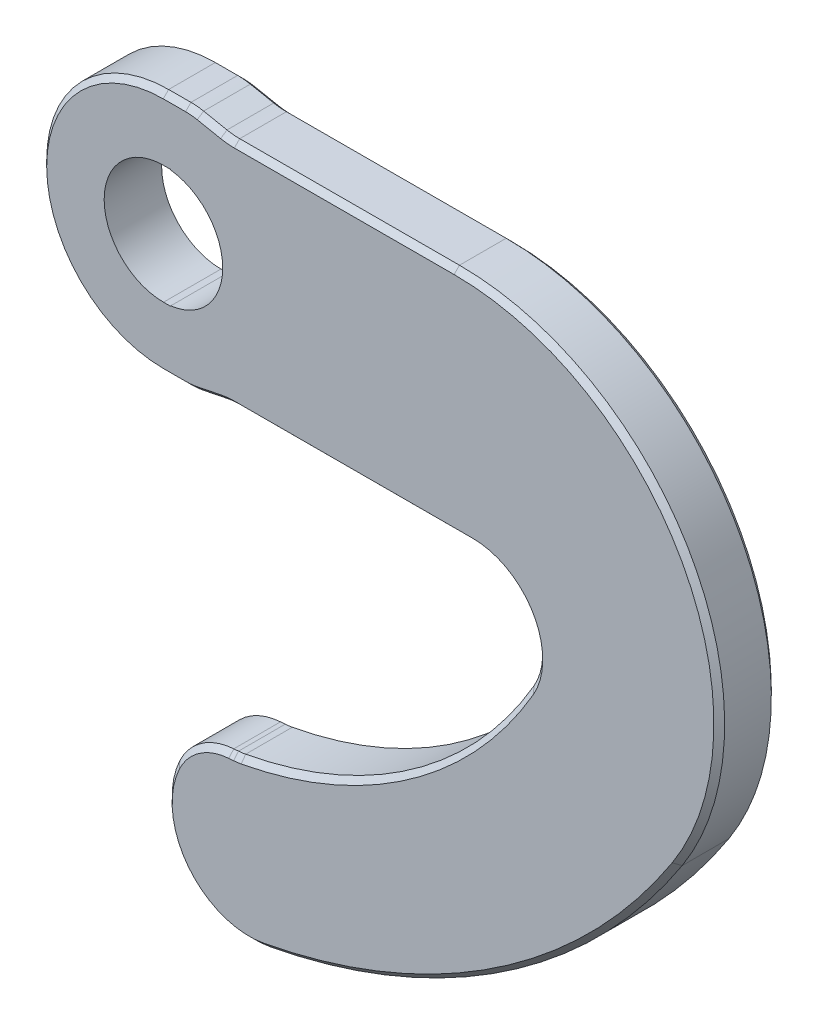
ISO-10303-21;
HEADER;
FILE_DESCRIPTION(('STEP AP214'),'2;1');
FILE_NAME('part.step','',(''),(''),'','','');
FILE_SCHEMA(('AUTOMOTIVE_DESIGN { 1 0 10303 214 1 1 1 1 }'));
ENDSEC;
DATA;
#1=APPLICATION_CONTEXT('core data for automotive mechanical design processes');
#2=APPLICATION_PROTOCOL_DEFINITION('international standard','automotive_design',2000,#1);
#3=PRODUCT_CONTEXT('',#1,'mechanical');
#4=PRODUCT('Part','Part','',(#3));
#5=PRODUCT_RELATED_PRODUCT_CATEGORY('part','',(#4));
#6=PRODUCT_DEFINITION_FORMATION('','',#4);
#7=PRODUCT_DEFINITION_CONTEXT('part definition',#1,'design');
#8=PRODUCT_DEFINITION('design','',#6,#7);
#9=PRODUCT_DEFINITION_SHAPE('','',#8);
#10=(LENGTH_UNIT() NAMED_UNIT(*) SI_UNIT(.MILLI.,.METRE.));
#11=(NAMED_UNIT(*) PLANE_ANGLE_UNIT() SI_UNIT($,.RADIAN.));
#12=(NAMED_UNIT(*) SI_UNIT($,.STERADIAN.) SOLID_ANGLE_UNIT());
#13=UNCERTAINTY_MEASURE_WITH_UNIT(LENGTH_MEASURE(1.E-05),#10,'distance_accuracy_value','');
#14=(GEOMETRIC_REPRESENTATION_CONTEXT(3) GLOBAL_UNCERTAINTY_ASSIGNED_CONTEXT((#13)) GLOBAL_UNIT_ASSIGNED_CONTEXT((#10,
#11,#12)) REPRESENTATION_CONTEXT('',''));
#15=CARTESIAN_POINT('',(0.,0.,0.));
#16=DIRECTION('',(0.,0.,1.));
#17=DIRECTION('',(1.,0.,0.));
#18=AXIS2_PLACEMENT_3D('',#15,#16,#17);
#19=CARTESIAN_POINT('',(1.99999776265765,0.00299154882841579,8.));
#20=DIRECTION('',(0.999998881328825,0.00149577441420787,0.));
#21=DIRECTION('',(0.00149577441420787,-0.999998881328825,0.));
#22=AXIS2_PLACEMENT_3D('',#19,#20,#21);
#23=PLANE('',#22);
#24=DIRECTION('',(0.,0.,-1.));
#25=VECTOR('',#24,1.);
#26=CARTESIAN_POINT('',(1.97531748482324,16.502973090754,7.99999999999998));
#27=LINE('',#26,#25);
#28=CARTESIAN_POINT('',(1.97531748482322,16.502973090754,8.));
#29=VERTEX_POINT('',#28);
#30=CARTESIAN_POINT('',(1.97531748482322,16.502973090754,-8.));
#31=VERTEX_POINT('',#30);
#32=EDGE_CURVE('E35',#29,#31,#27,.T.);
#33=ORIENTED_EDGE('',*,*,#32,.T.);
#34=DIRECTION('',(0.0014957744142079,-0.999998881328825,0.));
#35=VECTOR('',#34,1.);
#36=CARTESIAN_POINT('',(1.99999776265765,0.00299154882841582,-8.));
#37=LINE('',#36,#35);
#38=CARTESIAN_POINT('',(1.97549946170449,16.3813125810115,-8.));
#39=VERTEX_POINT('',#38);
#40=EDGE_CURVE('E552',#31,#39,#37,.T.);
#41=ORIENTED_EDGE('',*,*,#40,.T.);
#42=DIRECTION('',(0.,0.,-1.));
#43=VECTOR('',#42,1.);
#44=CARTESIAN_POINT('',(1.97549946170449,16.3813125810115,8.));
#45=LINE('',#44,#43);
#46=CARTESIAN_POINT('',(1.97549946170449,16.3813125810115,8.));
#47=VERTEX_POINT('',#46);
#48=EDGE_CURVE('E898',#47,#39,#45,.T.);
#49=ORIENTED_EDGE('',*,*,#48,.F.);
#50=DIRECTION('',(0.0014957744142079,-0.999998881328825,0.));
#51=VECTOR('',#50,1.);
#52=CARTESIAN_POINT('',(1.99999776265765,0.00299154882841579,8.));
#53=LINE('',#52,#51);
#54=EDGE_CURVE('E31',#29,#47,#53,.T.);
#55=ORIENTED_EDGE('',*,*,#54,.F.);
#56=EDGE_LOOP('',(#33,#41,#49,#55));
#57=FACE_BOUND('',#56,.T.);
#58=ADVANCED_FACE('F15',(#57),#23,.F.);
#59=CARTESIAN_POINT('',(0.,0.,-8.));
#60=DIRECTION('',(0.,0.,1.));
#61=DIRECTION('',(-0.999998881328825,-0.00149577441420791,0.));
#62=AXIS2_PLACEMENT_3D('',#59,#60,#61);
#63=PLANE('',#62);
#64=CARTESIAN_POINT('',(0.,0.,-8.));
#65=DIRECTION('',(0.,0.,1.));
#66=DIRECTION('',(-0.999998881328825,-0.00149577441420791,0.));
#67=AXIS2_PLACEMENT_3D('',#64,#65,#66);
#68=CIRCLE('',#67,32.5);
#69=CARTESIAN_POINT('',(0.0486126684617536,-32.4999636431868,-8.00000000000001));
#70=VERTEX_POINT('',#69);
#71=CARTESIAN_POINT('',(-0.0486126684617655,32.4999636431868,-7.99999999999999));
#72=VERTEX_POINT('',#71);
#73=EDGE_CURVE('E10',#70,#72,#68,.F.);
#74=ORIENTED_EDGE('',*,*,#73,.T.);
#75=DIRECTION('',(0.999998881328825,0.00149577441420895,0.));
#76=VECTOR('',#75,1.);
#77=CARTESIAN_POINT('',(-0.0486126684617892,32.4999636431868,-8.));
#78=LINE('',#77,#76);
#79=CARTESIAN_POINT('',(6.16902913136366,32.5092638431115,-8.));
#80=VERTEX_POINT('',#79);
#81=EDGE_CURVE('E420',#72,#80,#78,.T.);
#82=ORIENTED_EDGE('',*,*,#81,.T.);
#83=CARTESIAN_POINT('',(6.19370940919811,16.009282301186,-8.));
#84=DIRECTION('',(0.,0.,-1.));
#85=DIRECTION('',(-0.978326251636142,0.207069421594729,0.));
#86=AXIS2_PLACEMENT_3D('',#83,#84,#85);
#87=CIRCLE('',#86,16.5);
#88=CARTESIAN_POINT('',(9.40542101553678,32.1936855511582,-8.));
#89=VERTEX_POINT('',#88);
#90=EDGE_CURVE('E712',#80,#89,#87,.T.);
#91=ORIENTED_EDGE('',*,*,#90,.T.);
#92=DIRECTION('',(0.980872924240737,-0.194649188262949,0.));
#93=VECTOR('',#92,1.);
#94=CARTESIAN_POINT('',(15.9118812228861,30.9025119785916,-8.));
#95=LINE('',#94,#93);
#96=CARTESIAN_POINT('',(15.9118812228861,30.9025119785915,-8.));
#97=VERTEX_POINT('',#96);
#98=EDGE_CURVE('E718',#89,#97,#95,.T.);
#99=ORIENTED_EDGE('',*,*,#98,.T.);
#100=CARTESIAN_POINT('',(19.7075403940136,50.0295340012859,-8.));
#101=DIRECTION('',(0.,0.,-1.));
#102=DIRECTION('',(-0.978326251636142,0.207069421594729,0.));
#103=AXIS2_PLACEMENT_3D('',#100,#101,#102);
#104=CIRCLE('',#103,19.5);
#105=CARTESIAN_POINT('',(19.7367079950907,30.5295558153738,-8.));
#106=VERTEX_POINT('',#105);
#107=EDGE_CURVE('E748',#97,#106,#104,.F.);
#108=ORIENTED_EDGE('',*,*,#107,.T.);
#109=DIRECTION('',(0.999998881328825,0.00149577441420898,0.));
#110=VECTOR('',#109,1.);
#111=CARTESIAN_POINT('',(-0.0456211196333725,30.4999658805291,-8.));
#112=LINE('',#111,#110);
#113=CARTESIAN_POINT('',(80.926058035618,30.6210813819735,-7.99999999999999));
#114=VERTEX_POINT('',#113);
#115=EDGE_CURVE('E754',#106,#114,#112,.T.);
#116=ORIENTED_EDGE('',*,*,#115,.T.);
#117=CARTESIAN_POINT('',(81.0340667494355,-41.5880645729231,-7.99999999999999));
#118=DIRECTION('',(0.,0.,-1.));
#119=DIRECTION('',(-0.978326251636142,0.207069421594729,0.));
#120=AXIS2_PLACEMENT_3D('',#117,#118,#119);
#121=CIRCLE('',#120,72.2092267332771);
#122=CARTESIAN_POINT('',(141.647587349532,-80.8331094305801,-7.99999999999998));
#123=VERTEX_POINT('',#122);
#124=EDGE_CURVE('E751',#114,#123,#121,.T.);
#125=ORIENTED_EDGE('',*,*,#124,.T.);
#126=CARTESIAN_POINT('',(-3.9909452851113,13.4625310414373,-8.));
#127=DIRECTION('',(0.,0.,-1.));
#128=DIRECTION('',(-0.978326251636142,0.207069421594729,0.));
#129=AXIS2_PLACEMENT_3D('',#126,#127,#128);
#130=CIRCLE('',#129,173.5);
#131=CARTESIAN_POINT('',(27.8697048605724,-157.087018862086,-8.));
#132=VERTEX_POINT('',#131);
#133=EDGE_CURVE('E745',#123,#132,#130,.T.);
#134=ORIENTED_EDGE('',*,*,#133,.T.);
#135=CARTESIAN_POINT('',(23.9215551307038,-135.952636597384,-8.));
#136=DIRECTION('',(0.,0.,-1.));
#137=DIRECTION('',(-0.978326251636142,0.207069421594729,0.));
#138=AXIS2_PLACEMENT_3D('',#135,#136,#137);
#139=CIRCLE('',#138,21.4999999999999);
#140=CARTESIAN_POINT('',(4.43696355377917,-126.864144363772,-8.));
#141=VERTEX_POINT('',#140);
#142=EDGE_CURVE('E742',#132,#141,#139,.T.);
#143=ORIENTED_EDGE('',*,*,#142,.T.);
#144=CARTESIAN_POINT('',(19.3902547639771,-133.839033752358,-8.));
#145=DIRECTION('',(0.,0.,-1.));
#146=DIRECTION('',(-0.978326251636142,0.207069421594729,0.));
#147=AXIS2_PLACEMENT_3D('',#144,#145,#146);
#148=CIRCLE('',#147,16.5);
#149=CARTESIAN_POINT('',(18.2037699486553,-117.381748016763,-8.));
#150=VERTEX_POINT('',#149);
#151=EDGE_CURVE('E739',#141,#150,#148,.T.);
#152=ORIENTED_EDGE('',*,*,#151,.T.);
#153=DIRECTION('',(0.997411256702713,0.071908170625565,0.));
#154=VECTOR('',#153,1.);
#155=CARTESIAN_POINT('',(19.5132875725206,-117.28733859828,-8.));
#156=LINE('',#155,#154);
#157=CARTESIAN_POINT('',(19.5132875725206,-117.28733859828,-8.));
#158=VERTEX_POINT('',#157);
#159=EDGE_CURVE('E736',#150,#158,#156,.T.);
#160=ORIENTED_EDGE('',*,*,#159,.T.);
#161=CARTESIAN_POINT('',(18.1110782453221,-97.837819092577,-8.));
#162=DIRECTION('',(0.,0.,-1.));
#163=DIRECTION('',(-0.978326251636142,0.207069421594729,0.));
#164=AXIS2_PLACEMENT_3D('',#161,#162,#163);
#165=CIRCLE('',#164,19.5);
#166=CARTESIAN_POINT('',(21.6604855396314,-117.012065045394,-8.));
#167=VERTEX_POINT('',#166);
#168=EDGE_CURVE('E733',#158,#167,#165,.F.);
#169=ORIENTED_EDGE('',*,*,#168,.T.);
#170=CARTESIAN_POINT('',(0.,0.,-8.));
#171=DIRECTION('',(0.,0.,-1.));
#172=DIRECTION('',(-0.978326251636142,0.207069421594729,0.));
#173=AXIS2_PLACEMENT_3D('',#170,#171,#172);
#174=CIRCLE('',#173,119.);
#175=CARTESIAN_POINT('',(102.973149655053,-59.6450370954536,-7.99999999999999));
#176=VERTEX_POINT('',#175);
#177=EDGE_CURVE('E730',#167,#176,#174,.F.);
#178=ORIENTED_EDGE('',*,*,#177,.T.);
#179=CARTESIAN_POINT('',(86.0993982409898,-49.8712705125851,-7.99999999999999));
#180=DIRECTION('',(0.,0.,-1.));
#181=DIRECTION('',(-0.978326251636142,0.207069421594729,0.));
#182=AXIS2_PLACEMENT_3D('',#179,#180,#181);
#183=CIRCLE('',#182,19.5);
#184=CARTESIAN_POINT('',(86.0702306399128,-30.371292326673,-7.99999999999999));
#185=VERTEX_POINT('',#184);
#186=EDGE_CURVE('E727',#176,#185,#183,.F.);
#187=ORIENTED_EDGE('',*,*,#186,.T.);
#188=DIRECTION('',(-0.999998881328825,-0.00149577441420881,0.));
#189=VECTOR('',#188,1.);
#190=CARTESIAN_POINT('',(19.8279502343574,-30.4703759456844,-8.));
#191=LINE('',#190,#189);
#192=CARTESIAN_POINT('',(19.8279502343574,-30.4703759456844,-8.));
#193=VERTEX_POINT('',#192);
#194=EDGE_CURVE('E724',#185,#193,#191,.T.);
#195=ORIENTED_EDGE('',*,*,#194,.T.);
#196=CARTESIAN_POINT('',(19.8571178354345,-49.9703541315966,-8.));
#197=DIRECTION('',(0.,0.,-1.));
#198=DIRECTION('',(-0.978326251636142,0.207069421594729,0.));
#199=AXIS2_PLACEMENT_3D('',#196,#197,#198);
#200=CIRCLE('',#199,19.5);
#201=CARTESIAN_POINT('',(16.0042562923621,-30.8547725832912,-8.));
#202=VERTEX_POINT('',#201);
#203=EDGE_CURVE('E721',#193,#202,#200,.F.);
#204=ORIENTED_EDGE('',*,*,#203,.T.);
#205=DIRECTION('',(-0.980286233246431,-0.197582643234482,0.));
#206=VECTOR('',#205,1.);
#207=CARTESIAN_POINT('',(9.50168780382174,-32.1654047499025,-8.));
#208=LINE('',#207,#206);
#209=CARTESIAN_POINT('',(9.50168780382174,-32.1654047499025,-8.));
#210=VERTEX_POINT('',#209);
#211=EDGE_CURVE('E715',#202,#210,#208,.T.);
#212=ORIENTED_EDGE('',*,*,#211,.T.);
#213=CARTESIAN_POINT('',(6.24157419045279,-15.9906819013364,-8.));
#214=DIRECTION('',(0.,0.,-1.));
#215=DIRECTION('',(-0.978326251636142,0.207069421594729,0.));
#216=AXIS2_PLACEMENT_3D('',#213,#214,#215);
#217=CIRCLE('',#216,16.5);
#218=CARTESIAN_POINT('',(6.26625446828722,-32.490663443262,-8.));
#219=VERTEX_POINT('',#218);
#220=EDGE_CURVE('E708',#210,#219,#217,.T.);
#221=ORIENTED_EDGE('',*,*,#220,.T.);
#222=DIRECTION('',(-0.999998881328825,-0.00149577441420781,0.));
#223=VECTOR('',#222,1.);
#224=CARTESIAN_POINT('',(154.731436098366,-32.268592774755,-8.00000000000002));
#225=LINE('',#224,#223);
#226=EDGE_CURVE('E473',#219,#70,#225,.T.);
#227=ORIENTED_EDGE('',*,*,#226,.T.);
#228=EDGE_LOOP('',(#74,#82,#91,#99,#108,#116,#125,#134,#143,#152,#160,#169,#178,#187,#195,#204,
#212,#221,#227));
#229=FACE_BOUND('',#228,.T.);
#230=CARTESIAN_POINT('',(0.,0.,-8.));
#231=DIRECTION('',(0.,0.,-1.));
#232=DIRECTION('',(-0.999998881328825,-0.00149577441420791,0.));
#233=AXIS2_PLACEMENT_3D('',#230,#231,#232);
#234=CIRCLE('',#233,16.5);
#235=CARTESIAN_POINT('',(0.0246802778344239,-16.4999815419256,-8.));
#236=VERTEX_POINT('',#235);
#237=CARTESIAN_POINT('',(-0.0246802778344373,16.4999815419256,-8.));
#238=VERTEX_POINT('',#237);
#239=EDGE_CURVE('E443',#236,#238,#234,.T.);
#240=ORIENTED_EDGE('',*,*,#239,.F.);
#241=DIRECTION('',(-0.999998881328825,-0.00149577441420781,0.));
#242=VECTOR('',#241,1.);
#243=CARTESIAN_POINT('',(154.707503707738,-16.2686106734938,-8.00000000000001));
#244=LINE('',#243,#242);
#245=CARTESIAN_POINT('',(2.02467804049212,-16.4969899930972,-8.));
#246=VERTEX_POINT('',#245);
#247=EDGE_CURVE('E477',#246,#236,#244,.T.);
#248=ORIENTED_EDGE('',*,*,#247,.F.);
#249=DIRECTION('',(0.00149577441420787,-0.999998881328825,0.));
#250=VECTOR('',#249,1.);
#251=CARTESIAN_POINT('',(1.99999776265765,0.00299154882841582,-8.));
#252=LINE('',#251,#250);
#253=CARTESIAN_POINT('',(2.02449606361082,-16.3753294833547,-8.));
#254=VERTEX_POINT('',#253);
#255=EDGE_CURVE('E862',#254,#246,#252,.T.);
#256=ORIENTED_EDGE('',*,*,#255,.F.);
#257=CARTESIAN_POINT('',(0.,0.,-8.));
#258=DIRECTION('',(0.,0.,-1.));
#259=DIRECTION('',(-0.978326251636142,0.207069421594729,0.));
#260=AXIS2_PLACEMENT_3D('',#257,#258,#259);
#261=CIRCLE('',#260,16.5);
#262=EDGE_CURVE('E890',#39,#254,#261,.T.);
#263=ORIENTED_EDGE('',*,*,#262,.F.);
#264=ORIENTED_EDGE('',*,*,#40,.F.);
#265=DIRECTION('',(-0.999998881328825,-0.00149577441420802,0.));
#266=VECTOR('',#265,1.);
#267=CARTESIAN_POINT('',(154.65814315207,16.7313524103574,-8.));
#268=LINE('',#267,#266);
#269=EDGE_CURVE('E911',#31,#238,#268,.T.);
#270=ORIENTED_EDGE('',*,*,#269,.T.);
#271=EDGE_LOOP('',(#240,#248,#256,#263,#264,#270));
#272=FACE_BOUND('',#271,.T.);
#273=ADVANCED_FACE('F917',(#229,#272),#63,.F.);
#274=CARTESIAN_POINT('',(0.,0.,-8.));
#275=DIRECTION('',(0.,0.,1.));
#276=DIRECTION('',(-0.999998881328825,-0.00149577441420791,0.));
#277=AXIS2_PLACEMENT_3D('',#274,#275,#276);
#278=CYLINDRICAL_SURFACE('',#277,34.);
#279=DIRECTION('',(0.,0.,1.));
#280=VECTOR('',#279,1.);
#281=CARTESIAN_POINT('',(0.0508563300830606,-33.9999619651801,-8.00000000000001));
#282=LINE('',#281,#280);
#283=CARTESIAN_POINT('',(0.0508563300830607,-33.9999619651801,-6.50000000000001));
#284=VERTEX_POINT('',#283);
#285=CARTESIAN_POINT('',(0.0508563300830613,-33.9999619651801,6.49999999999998));
#286=VERTEX_POINT('',#285);
#287=EDGE_CURVE('E407',#284,#286,#282,.T.);
#288=ORIENTED_EDGE('',*,*,#287,.T.);
#289=CARTESIAN_POINT('',(0.,0.,6.49999999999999));
#290=DIRECTION('',(0.,0.,1.));
#291=DIRECTION('',(-0.999998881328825,-0.00149577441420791,0.));
#292=AXIS2_PLACEMENT_3D('',#289,#290,#291);
#293=CIRCLE('',#292,34.);
#294=CARTESIAN_POINT('',(-0.0508563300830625,33.9999619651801,6.5));
#295=VERTEX_POINT('',#294);
#296=EDGE_CURVE('E404',#286,#295,#293,.F.);
#297=ORIENTED_EDGE('',*,*,#296,.T.);
#298=DIRECTION('',(0.,0.,1.));
#299=VECTOR('',#298,1.);
#300=CARTESIAN_POINT('',(-0.0508563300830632,33.9999619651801,-7.99999999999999));
#301=LINE('',#300,#299);
#302=CARTESIAN_POINT('',(-0.0508563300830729,33.99996196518,-6.5));
#303=VERTEX_POINT('',#302);
#304=EDGE_CURVE('E386',#303,#295,#301,.T.);
#305=ORIENTED_EDGE('',*,*,#304,.F.);
#306=CARTESIAN_POINT('',(0.,0.,-6.50000000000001));
#307=DIRECTION('',(0.,0.,1.));
#308=DIRECTION('',(-0.999998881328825,-0.00149577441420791,0.));
#309=AXIS2_PLACEMENT_3D('',#306,#307,#308);
#310=CIRCLE('',#309,34.);
#311=EDGE_CURVE('E402',#303,#284,#310,.T.);
#312=ORIENTED_EDGE('',*,*,#311,.T.);
#313=EDGE_LOOP('',(#288,#297,#305,#312));
#314=FACE_BOUND('',#313,.T.);
#315=ADVANCED_FACE('F401',(#314),#278,.T.);
#316=CARTESIAN_POINT('',(0.,0.,-8.));
#317=DIRECTION('',(0.,0.,1.));
#318=DIRECTION('',(-0.999998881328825,-0.00149577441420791,0.));
#319=AXIS2_PLACEMENT_3D('',#316,#317,#318);
#320=CYLINDRICAL_SURFACE('',#319,16.5);
#321=DIRECTION('',(0.,0.,1.));
#322=VECTOR('',#321,1.);
#323=CARTESIAN_POINT('',(-0.0246802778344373,16.4999815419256,-8.));
#324=LINE('',#323,#322);
#325=CARTESIAN_POINT('',(-0.0246802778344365,16.4999815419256,8.));
#326=VERTEX_POINT('',#325);
#327=EDGE_CURVE('E408',#238,#326,#324,.T.);
#328=ORIENTED_EDGE('',*,*,#327,.T.);
#329=CARTESIAN_POINT('',(0.,0.,8.));
#330=DIRECTION('',(0.,0.,-1.));
#331=DIRECTION('',(-0.999998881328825,-0.00149577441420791,0.));
#332=AXIS2_PLACEMENT_3D('',#329,#330,#331);
#333=CIRCLE('',#332,16.5);
#334=CARTESIAN_POINT('',(0.0246802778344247,-16.4999815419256,8.));
#335=VERTEX_POINT('',#334);
#336=EDGE_CURVE('E452',#335,#326,#333,.T.);
#337=ORIENTED_EDGE('',*,*,#336,.F.);
#338=DIRECTION('',(0.,0.,1.));
#339=VECTOR('',#338,1.);
#340=CARTESIAN_POINT('',(0.0246802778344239,-16.4999815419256,-8.));
#341=LINE('',#340,#339);
#342=EDGE_CURVE('E441',#236,#335,#341,.T.);
#343=ORIENTED_EDGE('',*,*,#342,.F.);
#344=ORIENTED_EDGE('',*,*,#239,.T.);
#345=EDGE_LOOP('',(#328,#337,#343,#344));
#346=FACE_BOUND('',#345,.T.);
#347=ADVANCED_FACE('F924',(#346),#320,.F.);
#348=CARTESIAN_POINT('',(0.,0.,8.));
#349=DIRECTION('',(0.,0.,1.));
#350=DIRECTION('',(-0.999998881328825,-0.00149577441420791,0.));
#351=AXIS2_PLACEMENT_3D('',#348,#349,#350);
#352=PLANE('',#351);
#353=DIRECTION('',(-0.999998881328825,-0.00149577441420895,0.));
#354=VECTOR('',#353,1.);
#355=CARTESIAN_POINT('',(1.9513850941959,32.5029551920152,8.));
#356=LINE('',#355,#354);
#357=CARTESIAN_POINT('',(6.16902913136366,32.5092638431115,8.));
#358=VERTEX_POINT('',#357);
#359=CARTESIAN_POINT('',(-0.0486126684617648,32.4999636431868,8.00000000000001));
#360=VERTEX_POINT('',#359);
#361=EDGE_CURVE('E764',#358,#360,#356,.T.);
#362=ORIENTED_EDGE('',*,*,#361,.T.);
#363=CARTESIAN_POINT('',(0.,0.,8.));
#364=DIRECTION('',(0.,0.,1.));
#365=DIRECTION('',(-0.999998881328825,-0.00149577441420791,0.));
#366=AXIS2_PLACEMENT_3D('',#363,#364,#365);
#367=CIRCLE('',#366,32.5);
#368=CARTESIAN_POINT('',(0.0486126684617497,-32.4999636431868,7.99999999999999));
#369=VERTEX_POINT('',#368);
#370=EDGE_CURVE('E437',#360,#369,#367,.T.);
#371=ORIENTED_EDGE('',*,*,#370,.T.);
#372=DIRECTION('',(-0.999998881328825,-0.00149577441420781,0.));
#373=VECTOR('',#372,1.);
#374=CARTESIAN_POINT('',(154.731436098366,-32.268592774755,7.99999999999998));
#375=LINE('',#374,#373);
#376=CARTESIAN_POINT('',(6.26625446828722,-32.490663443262,8.));
#377=VERTEX_POINT('',#376);
#378=EDGE_CURVE('E462',#377,#369,#375,.T.);
#379=ORIENTED_EDGE('',*,*,#378,.F.);
#380=CARTESIAN_POINT('',(6.24157419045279,-15.9906819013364,8.));
#381=DIRECTION('',(0.,0.,-1.));
#382=DIRECTION('',(-0.978326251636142,0.207069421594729,0.));
#383=AXIS2_PLACEMENT_3D('',#380,#381,#382);
#384=CIRCLE('',#383,16.5);
#385=CARTESIAN_POINT('',(9.50168780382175,-32.1654047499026,8.));
#386=VERTEX_POINT('',#385);
#387=EDGE_CURVE('E767',#377,#386,#384,.F.);
#388=ORIENTED_EDGE('',*,*,#387,.T.);
#389=DIRECTION('',(0.980286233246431,0.197582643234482,0.));
#390=VECTOR('',#389,1.);
#391=CARTESIAN_POINT('',(6.6009737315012,-32.750061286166,8.));
#392=LINE('',#391,#390);
#393=CARTESIAN_POINT('',(16.0042562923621,-30.8547725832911,8.));
#394=VERTEX_POINT('',#393);
#395=EDGE_CURVE('E773',#386,#394,#392,.T.);
#396=ORIENTED_EDGE('',*,*,#395,.T.);
#397=CARTESIAN_POINT('',(19.8571178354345,-49.9703541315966,8.));
#398=DIRECTION('',(0.,0.,-1.));
#399=DIRECTION('',(-0.978326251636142,0.207069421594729,0.));
#400=AXIS2_PLACEMENT_3D('',#397,#398,#399);
#401=CIRCLE('',#400,19.5);
#402=CARTESIAN_POINT('',(19.8279502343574,-30.4703759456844,8.));
#403=VERTEX_POINT('',#402);
#404=EDGE_CURVE('E780',#394,#403,#401,.T.);
#405=ORIENTED_EDGE('',*,*,#404,.T.);
#406=DIRECTION('',(0.999998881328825,0.00149577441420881,0.));
#407=VECTOR('',#406,1.);
#408=CARTESIAN_POINT('',(0.0456211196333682,-30.4999658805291,8.));
#409=LINE('',#408,#407);
#410=CARTESIAN_POINT('',(86.0702306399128,-30.371292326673,8.00000000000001));
#411=VERTEX_POINT('',#410);
#412=EDGE_CURVE('E783',#403,#411,#409,.T.);
#413=ORIENTED_EDGE('',*,*,#412,.T.);
#414=CARTESIAN_POINT('',(86.0993982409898,-49.8712705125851,8.00000000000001));
#415=DIRECTION('',(0.,0.,-1.));
#416=DIRECTION('',(-0.978326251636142,0.207069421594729,0.));
#417=AXIS2_PLACEMENT_3D('',#414,#415,#416);
#418=CIRCLE('',#417,19.5);
#419=CARTESIAN_POINT('',(102.973149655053,-59.6450370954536,8.00000000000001));
#420=VERTEX_POINT('',#419);
#421=EDGE_CURVE('E786',#411,#420,#418,.T.);
#422=ORIENTED_EDGE('',*,*,#421,.T.);
#423=CARTESIAN_POINT('',(0.,0.,8.));
#424=DIRECTION('',(0.,0.,-1.));
#425=DIRECTION('',(-0.978326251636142,0.207069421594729,0.));
#426=AXIS2_PLACEMENT_3D('',#423,#424,#425);
#427=CIRCLE('',#426,119.);
#428=CARTESIAN_POINT('',(21.6604855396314,-117.012065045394,8.));
#429=VERTEX_POINT('',#428);
#430=EDGE_CURVE('E789',#420,#429,#427,.T.);
#431=ORIENTED_EDGE('',*,*,#430,.T.);
#432=CARTESIAN_POINT('',(18.1110782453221,-97.837819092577,8.));
#433=DIRECTION('',(0.,0.,-1.));
#434=DIRECTION('',(-0.978326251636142,0.207069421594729,0.));
#435=AXIS2_PLACEMENT_3D('',#432,#433,#434);
#436=CIRCLE('',#435,19.5);
#437=CARTESIAN_POINT('',(19.5132875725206,-117.28733859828,8.));
#438=VERTEX_POINT('',#437);
#439=EDGE_CURVE('E792',#429,#438,#436,.T.);
#440=ORIENTED_EDGE('',*,*,#439,.T.);
#441=DIRECTION('',(-0.997411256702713,-0.071908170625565,0.));
#442=VECTOR('',#441,1.);
#443=CARTESIAN_POINT('',(8.51298372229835,-118.080403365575,8.));
#444=LINE('',#443,#442);
#445=CARTESIAN_POINT('',(18.2037699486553,-117.381748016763,8.));
#446=VERTEX_POINT('',#445);
#447=EDGE_CURVE('E795',#438,#446,#444,.T.);
#448=ORIENTED_EDGE('',*,*,#447,.T.);
#449=CARTESIAN_POINT('',(19.3902547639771,-133.839033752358,8.));
#450=DIRECTION('',(0.,0.,-1.));
#451=DIRECTION('',(-0.978326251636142,0.207069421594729,0.));
#452=AXIS2_PLACEMENT_3D('',#449,#450,#451);
#453=CIRCLE('',#452,16.5);
#454=CARTESIAN_POINT('',(4.43696355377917,-126.864144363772,8.));
#455=VERTEX_POINT('',#454);
#456=EDGE_CURVE('E798',#446,#455,#453,.F.);
#457=ORIENTED_EDGE('',*,*,#456,.T.);
#458=CARTESIAN_POINT('',(23.9215551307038,-135.952636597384,8.));
#459=DIRECTION('',(0.,0.,-1.));
#460=DIRECTION('',(-0.978326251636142,0.207069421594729,0.));
#461=AXIS2_PLACEMENT_3D('',#458,#459,#460);
#462=CIRCLE('',#461,21.4999999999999);
#463=CARTESIAN_POINT('',(27.8697048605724,-157.087018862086,8.));
#464=VERTEX_POINT('',#463);
#465=EDGE_CURVE('E801',#455,#464,#462,.F.);
#466=ORIENTED_EDGE('',*,*,#465,.T.);
#467=CARTESIAN_POINT('',(-3.99094528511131,13.4625310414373,8.));
#468=DIRECTION('',(0.,0.,-1.));
#469=DIRECTION('',(-0.978326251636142,0.207069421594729,0.));
#470=AXIS2_PLACEMENT_3D('',#467,#468,#469);
#471=CIRCLE('',#470,173.5);
#472=CARTESIAN_POINT('',(141.647587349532,-80.8331094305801,8.00000000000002));
#473=VERTEX_POINT('',#472);
#474=EDGE_CURVE('E804',#464,#473,#471,.F.);
#475=ORIENTED_EDGE('',*,*,#474,.T.);
#476=CARTESIAN_POINT('',(81.0340667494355,-41.5880645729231,8.00000000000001));
#477=DIRECTION('',(0.,0.,-1.));
#478=DIRECTION('',(-0.978326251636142,0.207069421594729,0.));
#479=AXIS2_PLACEMENT_3D('',#476,#477,#478);
#480=CIRCLE('',#479,72.2092267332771);
#481=CARTESIAN_POINT('',(80.926058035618,30.6210813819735,8.00000000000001));
#482=VERTEX_POINT('',#481);
#483=EDGE_CURVE('E810',#473,#482,#480,.F.);
#484=ORIENTED_EDGE('',*,*,#483,.T.);
#485=DIRECTION('',(-0.999998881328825,-0.00149577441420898,0.));
#486=VECTOR('',#485,1.);
#487=CARTESIAN_POINT('',(19.7367079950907,30.5295558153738,8.));
#488=LINE('',#487,#486);
#489=CARTESIAN_POINT('',(19.7367079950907,30.5295558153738,8.));
#490=VERTEX_POINT('',#489);
#491=EDGE_CURVE('E813',#482,#490,#488,.T.);
#492=ORIENTED_EDGE('',*,*,#491,.T.);
#493=CARTESIAN_POINT('',(19.7075403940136,50.0295340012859,8.));
#494=DIRECTION('',(0.,0.,-1.));
#495=DIRECTION('',(-0.978326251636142,0.207069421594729,0.));
#496=AXIS2_PLACEMENT_3D('',#493,#494,#495);
#497=CIRCLE('',#496,19.5);
#498=CARTESIAN_POINT('',(15.9118812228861,30.9025119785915,8.));
#499=VERTEX_POINT('',#498);
#500=EDGE_CURVE('E807',#490,#499,#497,.T.);
#501=ORIENTED_EDGE('',*,*,#500,.T.);
#502=DIRECTION('',(-0.980872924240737,0.194649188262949,0.));
#503=VECTOR('',#502,1.);
#504=CARTESIAN_POINT('',(6.50297089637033,32.7696618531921,8.));
#505=LINE('',#504,#503);
#506=CARTESIAN_POINT('',(9.40542101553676,32.1936855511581,8.));
#507=VERTEX_POINT('',#506);
#508=EDGE_CURVE('E777',#499,#507,#505,.T.);
#509=ORIENTED_EDGE('',*,*,#508,.T.);
#510=CARTESIAN_POINT('',(6.19370940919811,16.009282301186,8.));
#511=DIRECTION('',(0.,0.,-1.));
#512=DIRECTION('',(-0.978326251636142,0.207069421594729,0.));
#513=AXIS2_PLACEMENT_3D('',#510,#511,#512);
#514=CIRCLE('',#513,16.5);
#515=EDGE_CURVE('E770',#507,#358,#514,.F.);
#516=ORIENTED_EDGE('',*,*,#515,.T.);
#517=EDGE_LOOP('',(#362,#371,#379,#388,#396,#405,#413,#422,#431,#440,#448,#457,#466,#475,#484,
#492,#501,#509,#516));
#518=FACE_BOUND('',#517,.T.);
#519=ORIENTED_EDGE('',*,*,#336,.T.);
#520=DIRECTION('',(-0.999998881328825,-0.00149577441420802,0.));
#521=VECTOR('',#520,1.);
#522=CARTESIAN_POINT('',(154.65814315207,16.7313524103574,8.));
#523=LINE('',#522,#521);
#524=EDGE_CURVE('E908',#29,#326,#523,.T.);
#525=ORIENTED_EDGE('',*,*,#524,.F.);
#526=ORIENTED_EDGE('',*,*,#54,.T.);
#527=CARTESIAN_POINT('',(0.,0.,8.));
#528=DIRECTION('',(0.,0.,-1.));
#529=DIRECTION('',(-0.978326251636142,0.207069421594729,0.));
#530=AXIS2_PLACEMENT_3D('',#527,#528,#529);
#531=CIRCLE('',#530,16.5);
#532=CARTESIAN_POINT('',(2.02449606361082,-16.3753294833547,8.));
#533=VERTEX_POINT('',#532);
#534=EDGE_CURVE('E872',#47,#533,#531,.T.);
#535=ORIENTED_EDGE('',*,*,#534,.T.);
#536=CARTESIAN_POINT('',(2.02467804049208,-16.4969899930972,8.));
#537=VERTEX_POINT('',#536);
#538=EDGE_CURVE('E904',#533,#537,#53,.T.);
#539=ORIENTED_EDGE('',*,*,#538,.T.);
#540=DIRECTION('',(-0.999998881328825,-0.00149577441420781,0.));
#541=VECTOR('',#540,1.);
#542=CARTESIAN_POINT('',(154.707503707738,-16.2686106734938,7.99999999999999));
#543=LINE('',#542,#541);
#544=EDGE_CURVE('E459',#537,#335,#543,.T.);
#545=ORIENTED_EDGE('',*,*,#544,.T.);
#546=EDGE_LOOP('',(#519,#525,#526,#535,#539,#545));
#547=FACE_BOUND('',#546,.T.);
#548=ADVANCED_FACE('F926',(#518,#547),#352,.T.);
#549=CARTESIAN_POINT('',(0.,0.,8.));
#550=DIRECTION('',(0.,0.,-1.));
#551=DIRECTION('',(0.999998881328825,0.00149577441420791,0.));
#552=AXIS2_PLACEMENT_3D('',#549,#550,#551);
#553=CONICAL_SURFACE('',#552,32.5,0.785398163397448);
#554=ORIENTED_EDGE('',*,*,#296,.F.);
#555=DIRECTION('',(0.00105767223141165,-0.707105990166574,-0.707106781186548));
#556=VECTOR('',#555,1.);
#557=CARTESIAN_POINT('',(0.,0.,40.5));
#558=LINE('',#557,#556);
#559=EDGE_CURVE('E417',#369,#286,#558,.T.);
#560=ORIENTED_EDGE('',*,*,#559,.F.);
#561=ORIENTED_EDGE('',*,*,#370,.F.);
#562=DIRECTION('',(0.00105767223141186,-0.707105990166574,0.707106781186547));
#563=VECTOR('',#562,1.);
#564=CARTESIAN_POINT('',(0.,0.,40.5));
#565=LINE('',#564,#563);
#566=EDGE_CURVE('E24',#295,#360,#565,.T.);
#567=ORIENTED_EDGE('',*,*,#566,.F.);
#568=EDGE_LOOP('',(#554,#560,#561,#567));
#569=FACE_BOUND('',#568,.T.);
#570=ADVANCED_FACE('F969',(#569),#553,.T.);
#571=CARTESIAN_POINT('',(0.,0.,-6.50000000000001));
#572=DIRECTION('',(0.,0.,1.));
#573=DIRECTION('',(-0.999998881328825,-0.00149577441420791,0.));
#574=AXIS2_PLACEMENT_3D('',#571,#572,#573);
#575=CONICAL_SURFACE('',#574,34.,0.785398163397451);
#576=DIRECTION('',(-0.00105767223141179,0.707105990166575,0.707106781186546));
#577=VECTOR('',#576,1.);
#578=CARTESIAN_POINT('',(0.,0.,-40.4999999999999));
#579=LINE('',#578,#577);
#580=EDGE_CURVE('E412',#72,#303,#579,.T.);
#581=ORIENTED_EDGE('',*,*,#580,.F.);
#582=ORIENTED_EDGE('',*,*,#73,.F.);
#583=DIRECTION('',(-0.00105767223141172,0.707105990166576,-0.707106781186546));
#584=VECTOR('',#583,1.);
#585=CARTESIAN_POINT('',(0.,0.,-40.4999999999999));
#586=LINE('',#585,#584);
#587=EDGE_CURVE('E414',#284,#70,#586,.T.);
#588=ORIENTED_EDGE('',*,*,#587,.F.);
#589=ORIENTED_EDGE('',*,*,#311,.F.);
#590=EDGE_LOOP('',(#581,#582,#588,#589));
#591=FACE_BOUND('',#590,.T.);
#592=ADVANCED_FACE('F17',(#591),#575,.T.);
#593=CARTESIAN_POINT('',(154.731436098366,-32.268592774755,7.99999999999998));
#594=DIRECTION('',(-0.00105767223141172,0.707105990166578,-0.707106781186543));
#595=DIRECTION('',(0.,0.70710717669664,0.707106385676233));
#596=AXIS2_PLACEMENT_3D('',#593,#594,#595);
#597=PLANE('',#596);
#598=DIRECTION('',(-0.999998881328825,-0.00149577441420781,0.));
#599=VECTOR('',#598,1.);
#600=CARTESIAN_POINT('',(154.733679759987,-33.7685910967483,6.49999999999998));
#601=LINE('',#600,#599);
#602=CARTESIAN_POINT('',(6.26849812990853,-33.9906617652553,6.49999999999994));
#603=VERTEX_POINT('',#602);
#604=EDGE_CURVE('E466',#603,#286,#601,.T.);
#605=ORIENTED_EDGE('',*,*,#604,.F.);
#606=DIRECTION('',(0.00105767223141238,-0.707105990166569,-0.707106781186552));
#607=VECTOR('',#606,1.);
#608=CARTESIAN_POINT('',(6.26625446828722,-32.4906634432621,8.));
#609=LINE('',#608,#607);
#610=EDGE_CURVE('E601',#377,#603,#609,.T.);
#611=ORIENTED_EDGE('',*,*,#610,.F.);
#612=ORIENTED_EDGE('',*,*,#378,.T.);
#613=ORIENTED_EDGE('',*,*,#559,.T.);
#614=EDGE_LOOP('',(#605,#611,#612,#613));
#615=FACE_BOUND('',#614,.T.);
#616=ADVANCED_FACE('F949',(#615),#597,.F.);
#617=CARTESIAN_POINT('',(154.733679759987,-33.7685910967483,6.49999999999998));
#618=DIRECTION('',(-0.00149577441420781,0.999998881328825,0.));
#619=DIRECTION('',(-0.999998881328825,-0.00149577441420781,0.));
#620=AXIS2_PLACEMENT_3D('',#617,#618,#619);
#621=PLANE('',#620);
#622=DIRECTION('',(-0.999998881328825,-0.00149577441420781,0.));
#623=VECTOR('',#622,1.);
#624=CARTESIAN_POINT('',(154.733679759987,-33.7685910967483,-6.50000000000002));
#625=LINE('',#624,#623);
#626=CARTESIAN_POINT('',(6.26849812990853,-33.9906617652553,-6.49999999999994));
#627=VERTEX_POINT('',#626);
#628=EDGE_CURVE('E470',#627,#284,#625,.T.);
#629=ORIENTED_EDGE('',*,*,#628,.F.);
#630=DIRECTION('',(0.,0.,-1.));
#631=VECTOR('',#630,1.);
#632=CARTESIAN_POINT('',(6.26849812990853,-33.9906617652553,8.));
#633=LINE('',#632,#631);
#634=EDGE_CURVE('E840',#627,#603,#633,.F.);
#635=ORIENTED_EDGE('',*,*,#634,.T.);
#636=ORIENTED_EDGE('',*,*,#604,.T.);
#637=ORIENTED_EDGE('',*,*,#287,.F.);
#638=EDGE_LOOP('',(#629,#635,#636,#637));
#639=FACE_BOUND('',#638,.T.);
#640=ADVANCED_FACE('F960',(#639),#621,.F.);
#641=CARTESIAN_POINT('',(154.707503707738,-16.2686106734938,-8.00000000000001));
#642=DIRECTION('',(0.00149577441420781,-0.999998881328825,0.));
#643=DIRECTION('',(0.999998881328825,0.00149577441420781,0.));
#644=AXIS2_PLACEMENT_3D('',#641,#642,#643);
#645=PLANE('',#644);
#646=DIRECTION('',(0.,0.,1.));
#647=VECTOR('',#646,1.);
#648=CARTESIAN_POINT('',(2.02467804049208,-16.4969899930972,-8.00000000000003));
#649=LINE('',#648,#647);
#650=EDGE_CURVE('E456',#246,#537,#649,.T.);
#651=ORIENTED_EDGE('',*,*,#650,.F.);
#652=ORIENTED_EDGE('',*,*,#247,.T.);
#653=ORIENTED_EDGE('',*,*,#342,.T.);
#654=ORIENTED_EDGE('',*,*,#544,.F.);
#655=EDGE_LOOP('',(#651,#652,#653,#654));
#656=FACE_BOUND('',#655,.T.);
#657=ADVANCED_FACE('F929',(#656),#645,.F.);
#658=CARTESIAN_POINT('',(154.733679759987,-33.7685910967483,-6.50000000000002));
#659=DIRECTION('',(-0.00105767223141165,0.707105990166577,0.707106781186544));
#660=DIRECTION('',(0.,-0.707107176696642,0.707106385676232));
#661=AXIS2_PLACEMENT_3D('',#658,#659,#660);
#662=PLANE('',#661);
#663=ORIENTED_EDGE('',*,*,#226,.F.);
#664=DIRECTION('',(-0.001057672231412,0.70710599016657,-0.707106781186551));
#665=VECTOR('',#664,1.);
#666=CARTESIAN_POINT('',(6.26849812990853,-33.9906617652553,-6.49999999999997));
#667=LINE('',#666,#665);
#668=EDGE_CURVE('E533',#627,#219,#667,.T.);
#669=ORIENTED_EDGE('',*,*,#668,.F.);
#670=ORIENTED_EDGE('',*,*,#628,.T.);
#671=ORIENTED_EDGE('',*,*,#587,.T.);
#672=EDGE_LOOP('',(#663,#669,#670,#671));
#673=FACE_BOUND('',#672,.T.);
#674=ADVANCED_FACE('F948',(#673),#662,.F.);
#675=ORIENTED_EDGE('',*,*,#255,.T.);
#676=ORIENTED_EDGE('',*,*,#650,.T.);
#677=ORIENTED_EDGE('',*,*,#538,.F.);
#678=DIRECTION('',(0.,0.,-1.));
#679=VECTOR('',#678,1.);
#680=CARTESIAN_POINT('',(2.02449606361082,-16.3753294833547,8.));
#681=LINE('',#680,#679);
#682=EDGE_CURVE('E894',#254,#533,#681,.F.);
#683=ORIENTED_EDGE('',*,*,#682,.F.);
#684=EDGE_LOOP('',(#675,#676,#677,#683));
#685=FACE_BOUND('',#684,.T.);
#686=ADVANCED_FACE('F932',(#685),#23,.F.);
#687=CARTESIAN_POINT('',(6.89734769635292,-34.2204906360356,8.));
#688=DIRECTION('',(-0.197582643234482,0.980286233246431,0.));
#689=DIRECTION('',(0.980286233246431,0.197582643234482,0.));
#690=AXIS2_PLACEMENT_3D('',#687,#688,#689);
#691=PLANE('',#690);
#692=DIRECTION('',(0.,0.,-1.));
#693=VECTOR('',#692,1.);
#694=CARTESIAN_POINT('',(16.3006302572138,-32.3252019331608,8.));
#695=LINE('',#694,#693);
#696=CARTESIAN_POINT('',(16.3006302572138,-32.3252019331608,-6.49999999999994));
#697=VERTEX_POINT('',#696);
#698=CARTESIAN_POINT('',(16.3006302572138,-32.3252019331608,6.49999999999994));
#699=VERTEX_POINT('',#698);
#700=EDGE_CURVE('E848',#697,#699,#695,.F.);
#701=ORIENTED_EDGE('',*,*,#700,.T.);
#702=DIRECTION('',(-0.980286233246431,-0.197582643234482,0.));
#703=VECTOR('',#702,1.);
#704=CARTESIAN_POINT('',(6.89734769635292,-34.2204906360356,6.50000000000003));
#705=LINE('',#704,#703);
#706=CARTESIAN_POINT('',(9.79806176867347,-33.6358340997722,6.49999999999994));
#707=VERTEX_POINT('',#706);
#708=EDGE_CURVE('E757',#699,#707,#705,.T.);
#709=ORIENTED_EDGE('',*,*,#708,.T.);
#710=DIRECTION('',(0.,0.,-1.));
#711=VECTOR('',#710,1.);
#712=CARTESIAN_POINT('',(9.79806176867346,-33.6358340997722,8.));
#713=LINE('',#712,#711);
#714=CARTESIAN_POINT('',(9.79806176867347,-33.6358340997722,-6.49999999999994));
#715=VERTEX_POINT('',#714);
#716=EDGE_CURVE('E844',#707,#715,#713,.T.);
#717=ORIENTED_EDGE('',*,*,#716,.T.);
#718=DIRECTION('',(0.980286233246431,0.197582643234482,0.));
#719=VECTOR('',#718,1.);
#720=CARTESIAN_POINT('',(16.3006302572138,-32.3252019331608,-6.49999999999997));
#721=LINE('',#720,#719);
#722=EDGE_CURVE('E760',#715,#697,#721,.T.);
#723=ORIENTED_EDGE('',*,*,#722,.T.);
#724=EDGE_LOOP('',(#701,#709,#717,#723));
#725=FACE_BOUND('',#724,.T.);
#726=ADVANCED_FACE('F947',(#725),#691,.F.);
#727=CARTESIAN_POINT('',(0.0478647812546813,-31.9999642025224,8.));
#728=DIRECTION('',(-0.00149577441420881,0.999998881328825,0.));
#729=DIRECTION('',(0.999998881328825,0.00149577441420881,0.));
#730=AXIS2_PLACEMENT_3D('',#727,#728,#729);
#731=PLANE('',#730);
#732=DIRECTION('',(0.,0.,-1.));
#733=VECTOR('',#732,1.);
#734=CARTESIAN_POINT('',(86.0724743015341,-31.8712906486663,8.00000000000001));
#735=LINE('',#734,#733);
#736=CARTESIAN_POINT('',(86.0724743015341,-31.8712906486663,6.49999999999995));
#737=VERTEX_POINT('',#736);
#738=CARTESIAN_POINT('',(86.0724743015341,-31.8712906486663,-6.49999999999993));
#739=VERTEX_POINT('',#738);
#740=EDGE_CURVE('E866',#737,#739,#735,.T.);
#741=ORIENTED_EDGE('',*,*,#740,.F.);
#742=DIRECTION('',(-0.999998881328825,-0.00149577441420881,0.));
#743=VECTOR('',#742,1.);
#744=CARTESIAN_POINT('',(0.0478647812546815,-31.9999642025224,6.49999999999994));
#745=LINE('',#744,#743);
#746=CARTESIAN_POINT('',(19.8301938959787,-31.9703742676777,6.49999999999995));
#747=VERTEX_POINT('',#746);
#748=EDGE_CURVE('E680',#737,#747,#745,.T.);
#749=ORIENTED_EDGE('',*,*,#748,.T.);
#750=DIRECTION('',(0.,0.,-1.));
#751=VECTOR('',#750,1.);
#752=CARTESIAN_POINT('',(19.8301938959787,-31.9703742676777,-8.));
#753=LINE('',#752,#751);
#754=CARTESIAN_POINT('',(19.8301938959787,-31.9703742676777,-6.49999999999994));
#755=VERTEX_POINT('',#754);
#756=EDGE_CURVE('E836',#747,#755,#753,.T.);
#757=ORIENTED_EDGE('',*,*,#756,.T.);
#758=DIRECTION('',(0.999998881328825,0.00149577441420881,0.));
#759=VECTOR('',#758,1.);
#760=CARTESIAN_POINT('',(86.0724743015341,-31.8712906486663,-6.49999999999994));
#761=LINE('',#760,#759);
#762=EDGE_CURVE('E683',#755,#739,#761,.T.);
#763=ORIENTED_EDGE('',*,*,#762,.T.);
#764=EDGE_LOOP('',(#741,#749,#757,#763));
#765=FACE_BOUND('',#764,.T.);
#766=ADVANCED_FACE('F954',(#765),#731,.F.);
#767=CARTESIAN_POINT('',(86.0993982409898,-49.8712705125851,8.00000000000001));
#768=DIRECTION('',(0.,0.,-1.));
#769=DIRECTION('',(-0.978326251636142,0.207069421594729,0.));
#770=AXIS2_PLACEMENT_3D('',#767,#768,#769);
#771=CYLINDRICAL_SURFACE('',#770,18.);
#772=DIRECTION('',(0.,0.,-1.));
#773=VECTOR('',#772,1.);
#774=CARTESIAN_POINT('',(101.675168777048,-58.8932088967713,8.00000000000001));
#775=LINE('',#774,#773);
#776=CARTESIAN_POINT('',(101.675168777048,-58.8932088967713,6.49999999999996));
#777=VERTEX_POINT('',#776);
#778=CARTESIAN_POINT('',(101.675168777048,-58.8932088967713,-6.49999999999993));
#779=VERTEX_POINT('',#778);
#780=EDGE_CURVE('E880',#777,#779,#775,.T.);
#781=ORIENTED_EDGE('',*,*,#780,.F.);
#782=CARTESIAN_POINT('',(86.0993982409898,-49.8712705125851,6.49999999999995));
#783=DIRECTION('',(0.,0.,-1.));
#784=DIRECTION('',(-0.978326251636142,0.207069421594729,0.));
#785=AXIS2_PLACEMENT_3D('',#782,#783,#784);
#786=CIRCLE('',#785,18.);
#787=EDGE_CURVE('E674',#777,#737,#786,.F.);
#788=ORIENTED_EDGE('',*,*,#787,.T.);
#789=ORIENTED_EDGE('',*,*,#740,.T.);
#790=CARTESIAN_POINT('',(86.0993982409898,-49.8712705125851,-6.49999999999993));
#791=DIRECTION('',(0.,0.,-1.));
#792=DIRECTION('',(-0.978326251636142,0.207069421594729,0.));
#793=AXIS2_PLACEMENT_3D('',#790,#791,#792);
#794=CIRCLE('',#793,18.);
#795=EDGE_CURVE('E677',#739,#779,#794,.T.);
#796=ORIENTED_EDGE('',*,*,#795,.T.);
#797=EDGE_LOOP('',(#781,#788,#789,#796));
#798=FACE_BOUND('',#797,.T.);
#799=ADVANCED_FACE('F1063',(#798),#771,.F.);
#800=CARTESIAN_POINT('',(0.,0.,8.));
#801=DIRECTION('',(0.,0.,-1.));
#802=DIRECTION('',(-0.978326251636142,0.207069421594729,0.));
#803=AXIS2_PLACEMENT_3D('',#800,#801,#802);
#804=CYLINDRICAL_SURFACE('',#803,117.5);
#805=DIRECTION('',(0.,0.,-1.));
#806=VECTOR('',#805,1.);
#807=CARTESIAN_POINT('',(21.3874542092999,-115.537123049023,8.));
#808=LINE('',#807,#806);
#809=CARTESIAN_POINT('',(21.3874542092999,-115.537123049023,-6.49999999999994));
#810=VERTEX_POINT('',#809);
#811=CARTESIAN_POINT('',(21.3874542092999,-115.537123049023,6.49999999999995));
#812=VERTEX_POINT('',#811);
#813=EDGE_CURVE('E816',#810,#812,#808,.F.);
#814=ORIENTED_EDGE('',*,*,#813,.T.);
#815=CARTESIAN_POINT('',(0.,0.,6.49999999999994));
#816=DIRECTION('',(0.,0.,-1.));
#817=DIRECTION('',(-0.978326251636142,0.207069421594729,0.));
#818=AXIS2_PLACEMENT_3D('',#815,#816,#817);
#819=CIRCLE('',#818,117.5);
#820=EDGE_CURVE('E668',#812,#777,#819,.F.);
#821=ORIENTED_EDGE('',*,*,#820,.T.);
#822=ORIENTED_EDGE('',*,*,#780,.T.);
#823=CARTESIAN_POINT('',(0.,0.,-6.49999999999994));
#824=DIRECTION('',(0.,0.,-1.));
#825=DIRECTION('',(-0.978326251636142,0.207069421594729,0.));
#826=AXIS2_PLACEMENT_3D('',#823,#824,#825);
#827=CIRCLE('',#826,117.5);
#828=EDGE_CURVE('E671',#779,#810,#827,.T.);
#829=ORIENTED_EDGE('',*,*,#828,.T.);
#830=EDGE_LOOP('',(#814,#821,#822,#829));
#831=FACE_BOUND('',#830,.T.);
#832=ADVANCED_FACE('F1067',(#831),#804,.F.);
#833=CARTESIAN_POINT('',(8.40512146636,-116.584286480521,8.));
#834=DIRECTION('',(0.071908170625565,-0.997411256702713,0.));
#835=DIRECTION('',(-0.997411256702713,-0.071908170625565,0.));
#836=AXIS2_PLACEMENT_3D('',#833,#834,#835);
#837=PLANE('',#836);
#838=DIRECTION('',(0.,0.,1.));
#839=VECTOR('',#838,1.);
#840=CARTESIAN_POINT('',(18.095907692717,-115.885631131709,8.));
#841=LINE('',#840,#839);
#842=CARTESIAN_POINT('',(18.095907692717,-115.885631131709,-6.49999999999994));
#843=VERTEX_POINT('',#842);
#844=CARTESIAN_POINT('',(18.095907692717,-115.885631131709,6.49999999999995));
#845=VERTEX_POINT('',#844);
#846=EDGE_CURVE('E820',#843,#845,#841,.T.);
#847=ORIENTED_EDGE('',*,*,#846,.T.);
#848=DIRECTION('',(0.997411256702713,0.071908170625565,0.));
#849=VECTOR('',#848,1.);
#850=CARTESIAN_POINT('',(8.40512146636,-116.584286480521,6.49999999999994));
#851=LINE('',#850,#849);
#852=CARTESIAN_POINT('',(19.4054253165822,-115.791221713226,6.49999999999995));
#853=VERTEX_POINT('',#852);
#854=EDGE_CURVE('E656',#845,#853,#851,.T.);
#855=ORIENTED_EDGE('',*,*,#854,.T.);
#856=DIRECTION('',(0.,0.,1.));
#857=VECTOR('',#856,1.);
#858=CARTESIAN_POINT('',(19.4054253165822,-115.791221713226,-8.));
#859=LINE('',#858,#857);
#860=CARTESIAN_POINT('',(19.4054253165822,-115.791221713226,-6.49999999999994));
#861=VERTEX_POINT('',#860);
#862=EDGE_CURVE('E824',#853,#861,#859,.F.);
#863=ORIENTED_EDGE('',*,*,#862,.T.);
#864=DIRECTION('',(-0.997411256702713,-0.071908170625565,0.));
#865=VECTOR('',#864,1.);
#866=CARTESIAN_POINT('',(18.095907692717,-115.885631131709,-6.49999999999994));
#867=LINE('',#866,#865);
#868=EDGE_CURVE('E659',#861,#843,#867,.T.);
#869=ORIENTED_EDGE('',*,*,#868,.T.);
#870=EDGE_LOOP('',(#847,#855,#863,#869));
#871=FACE_BOUND('',#870,.T.);
#872=ADVANCED_FACE('F1085',(#871),#837,.F.);
#873=CARTESIAN_POINT('',(23.9215551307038,-135.952636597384,8.));
#874=DIRECTION('',(0.,0.,-1.));
#875=DIRECTION('',(-0.978326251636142,0.207069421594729,0.));
#876=AXIS2_PLACEMENT_3D('',#873,#874,#875);
#877=CYLINDRICAL_SURFACE('',#876,23.);
#878=DIRECTION('',(0.,0.,-1.));
#879=VECTOR('',#878,1.);
#880=CARTESIAN_POINT('',(28.1451571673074,-158.561510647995,8.));
#881=LINE('',#880,#879);
#882=CARTESIAN_POINT('',(28.1451571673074,-158.561510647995,6.49999999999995));
#883=VERTEX_POINT('',#882);
#884=CARTESIAN_POINT('',(28.1451571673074,-158.561510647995,-6.49999999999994));
#885=VERTEX_POINT('',#884);
#886=EDGE_CURVE('E876',#883,#885,#881,.T.);
#887=ORIENTED_EDGE('',*,*,#886,.F.);
#888=CARTESIAN_POINT('',(23.9215551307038,-135.952636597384,6.49999999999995));
#889=DIRECTION('',(0.,0.,-1.));
#890=DIRECTION('',(-0.978326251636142,0.207069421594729,0.));
#891=AXIS2_PLACEMENT_3D('',#888,#889,#890);
#892=CIRCLE('',#891,23.);
#893=CARTESIAN_POINT('',(3.07757344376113,-126.230063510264,6.49999999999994));
#894=VERTEX_POINT('',#893);
#895=EDGE_CURVE('E638',#883,#894,#892,.T.);
#896=ORIENTED_EDGE('',*,*,#895,.T.);
#897=DIRECTION('',(0.,0.,-1.));
#898=VECTOR('',#897,1.);
#899=CARTESIAN_POINT('',(3.07757344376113,-126.230063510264,8.));
#900=LINE('',#899,#898);
#901=CARTESIAN_POINT('',(3.07757344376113,-126.230063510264,-6.49999999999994));
#902=VERTEX_POINT('',#901);
#903=EDGE_CURVE('E828',#894,#902,#900,.T.);
#904=ORIENTED_EDGE('',*,*,#903,.T.);
#905=CARTESIAN_POINT('',(23.9215551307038,-135.952636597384,-6.49999999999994));
#906=DIRECTION('',(0.,0.,-1.));
#907=DIRECTION('',(-0.978326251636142,0.207069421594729,0.));
#908=AXIS2_PLACEMENT_3D('',#905,#906,#907);
#909=CIRCLE('',#908,23.);
#910=EDGE_CURVE('E641',#902,#885,#909,.F.);
#911=ORIENTED_EDGE('',*,*,#910,.T.);
#912=EDGE_LOOP('',(#887,#896,#904,#911));
#913=FACE_BOUND('',#912,.T.);
#914=ADVANCED_FACE('F1104',(#913),#877,.T.);
#915=CARTESIAN_POINT('',(-3.99094528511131,13.4625310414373,8.));
#916=DIRECTION('',(0.,0.,-1.));
#917=DIRECTION('',(-0.978326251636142,0.207069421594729,0.));
#918=AXIS2_PLACEMENT_3D('',#915,#916,#917);
#919=CYLINDRICAL_SURFACE('',#918,175.);
#920=DIRECTION('',(0.,0.,-1.));
#921=VECTOR('',#920,1.);
#922=CARTESIAN_POINT('',(142.906710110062,-81.6483455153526,8.00000000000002));
#923=LINE('',#922,#921);
#924=CARTESIAN_POINT('',(142.906710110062,-81.6483455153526,6.49999999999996));
#925=VERTEX_POINT('',#924);
#926=CARTESIAN_POINT('',(142.906710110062,-81.6483455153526,-6.49999999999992));
#927=VERTEX_POINT('',#926);
#928=EDGE_CURVE('E871',#925,#927,#923,.T.);
#929=ORIENTED_EDGE('',*,*,#928,.F.);
#930=CARTESIAN_POINT('',(-3.99094528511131,13.4625310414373,6.49999999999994));
#931=DIRECTION('',(0.,0.,-1.));
#932=DIRECTION('',(-0.978326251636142,0.207069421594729,0.));
#933=AXIS2_PLACEMENT_3D('',#930,#931,#932);
#934=CIRCLE('',#933,175.);
#935=EDGE_CURVE('E632',#925,#883,#934,.T.);
#936=ORIENTED_EDGE('',*,*,#935,.T.);
#937=ORIENTED_EDGE('',*,*,#886,.T.);
#938=CARTESIAN_POINT('',(-3.9909452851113,13.4625310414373,-6.49999999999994));
#939=DIRECTION('',(0.,0.,-1.));
#940=DIRECTION('',(-0.978326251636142,0.207069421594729,0.));
#941=AXIS2_PLACEMENT_3D('',#938,#939,#940);
#942=CIRCLE('',#941,175.);
#943=EDGE_CURVE('E635',#885,#927,#942,.F.);
#944=ORIENTED_EDGE('',*,*,#943,.T.);
#945=EDGE_LOOP('',(#929,#936,#937,#944));
#946=FACE_BOUND('',#945,.T.);
#947=ADVANCED_FACE('F1117',(#946),#919,.T.);
#948=CARTESIAN_POINT('',(81.0340667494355,-41.5880645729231,8.00000000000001));
#949=DIRECTION('',(0.,0.,-1.));
#950=DIRECTION('',(-0.978326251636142,0.207069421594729,0.));
#951=AXIS2_PLACEMENT_3D('',#948,#949,#950);
#952=CYLINDRICAL_SURFACE('',#951,73.7092267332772);
#953=DIRECTION('',(0.,0.,-1.));
#954=VECTOR('',#953,1.);
#955=CARTESIAN_POINT('',(80.9238143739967,32.1210797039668,8.00000000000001));
#956=LINE('',#955,#954);
#957=CARTESIAN_POINT('',(80.9238143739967,32.1210797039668,6.49999999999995));
#958=VERTEX_POINT('',#957);
#959=CARTESIAN_POINT('',(80.9238143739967,32.1210797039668,-6.49999999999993));
#960=VERTEX_POINT('',#959);
#961=EDGE_CURVE('E867',#958,#960,#956,.T.);
#962=ORIENTED_EDGE('',*,*,#961,.F.);
#963=CARTESIAN_POINT('',(81.0340667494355,-41.5880645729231,6.49999999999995));
#964=DIRECTION('',(0.,0.,-1.));
#965=DIRECTION('',(-0.978326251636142,0.207069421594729,0.));
#966=AXIS2_PLACEMENT_3D('',#963,#964,#965);
#967=CIRCLE('',#966,73.7092267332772);
#968=EDGE_CURVE('E620',#958,#925,#967,.T.);
#969=ORIENTED_EDGE('',*,*,#968,.T.);
#970=ORIENTED_EDGE('',*,*,#928,.T.);
#971=CARTESIAN_POINT('',(81.0340667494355,-41.5880645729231,-6.49999999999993));
#972=DIRECTION('',(0.,0.,-1.));
#973=DIRECTION('',(-0.978326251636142,0.207069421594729,0.));
#974=AXIS2_PLACEMENT_3D('',#971,#972,#973);
#975=CIRCLE('',#974,73.7092267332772);
#976=EDGE_CURVE('E623',#927,#960,#975,.F.);
#977=ORIENTED_EDGE('',*,*,#976,.T.);
#978=EDGE_LOOP('',(#962,#969,#970,#977));
#979=FACE_BOUND('',#978,.T.);
#980=ADVANCED_FACE('F1122',(#979),#952,.T.);
#981=CARTESIAN_POINT('',(-0.0478647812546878,31.9999642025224,8.));
#982=DIRECTION('',(-0.00149577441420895,0.999998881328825,0.));
#983=DIRECTION('',(0.999998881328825,0.00149577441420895,0.));
#984=AXIS2_PLACEMENT_3D('',#981,#982,#983);
#985=PLANE('',#984);
#986=DIRECTION('',(0.,0.,-1.));
#987=VECTOR('',#986,1.);
#988=CARTESIAN_POINT('',(19.7344643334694,32.0295541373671,8.));
#989=LINE('',#988,#987);
#990=CARTESIAN_POINT('',(19.7344643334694,32.0295541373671,-6.49999999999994));
#991=VERTEX_POINT('',#990);
#992=CARTESIAN_POINT('',(19.7344643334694,32.0295541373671,6.49999999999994));
#993=VERTEX_POINT('',#992);
#994=EDGE_CURVE('E832',#991,#993,#989,.F.);
#995=ORIENTED_EDGE('',*,*,#994,.T.);
#996=DIRECTION('',(0.999998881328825,0.00149577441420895,0.));
#997=VECTOR('',#996,1.);
#998=CARTESIAN_POINT('',(80.9238143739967,32.1210797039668,6.49999999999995));
#999=LINE('',#998,#997);
#1000=EDGE_CURVE('E480',#993,#958,#999,.T.);
#1001=ORIENTED_EDGE('',*,*,#1000,.T.);
#1002=ORIENTED_EDGE('',*,*,#961,.T.);
#1003=DIRECTION('',(-0.999998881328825,-0.00149577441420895,0.));
#1004=VECTOR('',#1003,1.);
#1005=CARTESIAN_POINT('',(-0.0478647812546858,31.9999642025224,-6.49999999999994));
#1006=LINE('',#1005,#1004);
#1007=EDGE_CURVE('E617',#960,#991,#1006,.T.);
#1008=ORIENTED_EDGE('',*,*,#1007,.T.);
#1009=EDGE_LOOP('',(#995,#1001,#1002,#1008));
#1010=FACE_BOUND('',#1009,.T.);
#1011=ADVANCED_FACE('F1134',(#1010),#985,.T.);
#1012=CARTESIAN_POINT('',(6.79494467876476,34.2409712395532,8.));
#1013=DIRECTION('',(-0.194649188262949,-0.980872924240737,0.));
#1014=DIRECTION('',(-0.980872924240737,0.194649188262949,0.));
#1015=AXIS2_PLACEMENT_3D('',#1012,#1013,#1014);
#1016=PLANE('',#1015);
#1017=DIRECTION('',(0.,0.,-1.));
#1018=VECTOR('',#1017,1.);
#1019=CARTESIAN_POINT('',(16.2038550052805,32.3738213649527,8.));
#1020=LINE('',#1019,#1018);
#1021=CARTESIAN_POINT('',(16.2038550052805,32.3738213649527,6.49999999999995));
#1022=VERTEX_POINT('',#1021);
#1023=CARTESIAN_POINT('',(16.2038550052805,32.3738213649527,-6.49999999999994));
#1024=VERTEX_POINT('',#1023);
#1025=EDGE_CURVE('E856',#1022,#1024,#1020,.T.);
#1026=ORIENTED_EDGE('',*,*,#1025,.T.);
#1027=DIRECTION('',(-0.980872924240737,0.194649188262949,0.));
#1028=VECTOR('',#1027,1.);
#1029=CARTESIAN_POINT('',(9.69739479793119,33.6649949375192,-6.50000000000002));
#1030=LINE('',#1029,#1028);
#1031=CARTESIAN_POINT('',(9.69739479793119,33.6649949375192,-6.49999999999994));
#1032=VERTEX_POINT('',#1031);
#1033=EDGE_CURVE('E699',#1024,#1032,#1030,.T.);
#1034=ORIENTED_EDGE('',*,*,#1033,.T.);
#1035=DIRECTION('',(0.,0.,-1.));
#1036=VECTOR('',#1035,1.);
#1037=CARTESIAN_POINT('',(9.69739479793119,33.6649949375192,8.));
#1038=LINE('',#1037,#1036);
#1039=CARTESIAN_POINT('',(9.69739479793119,33.6649949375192,6.49999999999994));
#1040=VERTEX_POINT('',#1039);
#1041=EDGE_CURVE('E852',#1032,#1040,#1038,.F.);
#1042=ORIENTED_EDGE('',*,*,#1041,.T.);
#1043=DIRECTION('',(0.980872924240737,-0.194649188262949,0.));
#1044=VECTOR('',#1043,1.);
#1045=CARTESIAN_POINT('',(6.79494467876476,34.2409712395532,6.5));
#1046=LINE('',#1045,#1044);
#1047=EDGE_CURVE('E394',#1040,#1022,#1046,.T.);
#1048=ORIENTED_EDGE('',*,*,#1047,.T.);
#1049=EDGE_LOOP('',(#1026,#1034,#1042,#1048));
#1050=FACE_BOUND('',#1049,.T.);
#1051=ADVANCED_FACE('F1396',(#1050),#1016,.F.);
#1052=CARTESIAN_POINT('',(-0.0508563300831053,33.9999619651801,8.));
#1053=DIRECTION('',(-0.00149577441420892,0.999998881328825,0.));
#1054=DIRECTION('',(0.999998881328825,0.00149577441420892,0.));
#1055=AXIS2_PLACEMENT_3D('',#1052,#1053,#1054);
#1056=PLANE('',#1055);
#1057=DIRECTION('',(0.,0.,-1.));
#1058=VECTOR('',#1057,1.);
#1059=CARTESIAN_POINT('',(6.16678546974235,34.0092621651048,-8.));
#1060=LINE('',#1059,#1058);
#1061=CARTESIAN_POINT('',(6.16678546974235,34.0092621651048,6.49999999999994));
#1062=VERTEX_POINT('',#1061);
#1063=CARTESIAN_POINT('',(6.16678546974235,34.0092621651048,-6.49999999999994));
#1064=VERTEX_POINT('',#1063);
#1065=EDGE_CURVE('E388',#1062,#1064,#1060,.T.);
#1066=ORIENTED_EDGE('',*,*,#1065,.T.);
#1067=DIRECTION('',(-0.999998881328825,-0.00149577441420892,0.));
#1068=VECTOR('',#1067,1.);
#1069=CARTESIAN_POINT('',(-0.0508563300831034,33.9999619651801,-6.49999999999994));
#1070=LINE('',#1069,#1068);
#1071=EDGE_CURVE('E383',#1064,#303,#1070,.T.);
#1072=ORIENTED_EDGE('',*,*,#1071,.T.);
#1073=ORIENTED_EDGE('',*,*,#304,.T.);
#1074=DIRECTION('',(0.999998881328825,0.00149577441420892,0.));
#1075=VECTOR('',#1074,1.);
#1076=CARTESIAN_POINT('',(6.16678546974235,34.0092621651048,6.50000000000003));
#1077=LINE('',#1076,#1075);
#1078=EDGE_CURVE('E395',#295,#1062,#1077,.T.);
#1079=ORIENTED_EDGE('',*,*,#1078,.T.);
#1080=EDGE_LOOP('',(#1066,#1072,#1073,#1079));
#1081=FACE_BOUND('',#1080,.T.);
#1082=ADVANCED_FACE('F385',(#1081),#1056,.T.);
#1083=CARTESIAN_POINT('',(0.,0.,8.));
#1084=DIRECTION('',(0.,0.,-1.));
#1085=DIRECTION('',(-0.978326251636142,0.207069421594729,0.));
#1086=AXIS2_PLACEMENT_3D('',#1083,#1084,#1085);
#1087=CYLINDRICAL_SURFACE('',#1086,16.5);
#1088=ORIENTED_EDGE('',*,*,#262,.T.);
#1089=ORIENTED_EDGE('',*,*,#682,.T.);
#1090=ORIENTED_EDGE('',*,*,#534,.F.);
#1091=ORIENTED_EDGE('',*,*,#48,.T.);
#1092=EDGE_LOOP('',(#1088,#1089,#1090,#1091));
#1093=FACE_BOUND('',#1092,.T.);
#1094=ADVANCED_FACE('F935',(#1093),#1087,.F.);
#1095=CARTESIAN_POINT('',(6.19370940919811,16.009282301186,8.));
#1096=DIRECTION('',(0.,0.,1.));
#1097=DIRECTION('',(0.978326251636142,-0.207069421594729,0.));
#1098=AXIS2_PLACEMENT_3D('',#1095,#1096,#1097);
#1099=CYLINDRICAL_SURFACE('',#1098,18.);
#1100=ORIENTED_EDGE('',*,*,#1065,.F.);
#1101=CARTESIAN_POINT('',(6.19370940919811,16.009282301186,6.49999999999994));
#1102=DIRECTION('',(0.,0.,-1.));
#1103=DIRECTION('',(-0.978326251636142,0.207069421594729,0.));
#1104=AXIS2_PLACEMENT_3D('',#1101,#1102,#1103);
#1105=CIRCLE('',#1104,18.);
#1106=EDGE_CURVE('E644',#1062,#1040,#1105,.T.);
#1107=ORIENTED_EDGE('',*,*,#1106,.T.);
#1108=ORIENTED_EDGE('',*,*,#1041,.F.);
#1109=CARTESIAN_POINT('',(6.19370940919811,16.009282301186,-6.49999999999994));
#1110=DIRECTION('',(0.,0.,-1.));
#1111=DIRECTION('',(-0.978326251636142,0.207069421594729,0.));
#1112=AXIS2_PLACEMENT_3D('',#1109,#1110,#1111);
#1113=CIRCLE('',#1112,18.);
#1114=EDGE_CURVE('E647',#1032,#1064,#1113,.F.);
#1115=ORIENTED_EDGE('',*,*,#1114,.T.);
#1116=EDGE_LOOP('',(#1100,#1107,#1108,#1115));
#1117=FACE_BOUND('',#1116,.T.);
#1118=ADVANCED_FACE('F995',(#1117),#1099,.T.);
#1119=CARTESIAN_POINT('',(6.24157419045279,-15.9906819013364,8.));
#1120=DIRECTION('',(0.,0.,-1.));
#1121=DIRECTION('',(-0.978326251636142,0.207069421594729,0.));
#1122=AXIS2_PLACEMENT_3D('',#1119,#1120,#1121);
#1123=CYLINDRICAL_SURFACE('',#1122,18.);
#1124=ORIENTED_EDGE('',*,*,#716,.F.);
#1125=CARTESIAN_POINT('',(6.24157419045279,-15.9906819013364,6.49999999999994));
#1126=DIRECTION('',(0.,0.,-1.));
#1127=DIRECTION('',(-0.978326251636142,0.207069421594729,0.));
#1128=AXIS2_PLACEMENT_3D('',#1125,#1126,#1127);
#1129=CIRCLE('',#1128,18.);
#1130=EDGE_CURVE('E692',#707,#603,#1129,.T.);
#1131=ORIENTED_EDGE('',*,*,#1130,.T.);
#1132=ORIENTED_EDGE('',*,*,#634,.F.);
#1133=CARTESIAN_POINT('',(6.24157419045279,-15.9906819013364,-6.49999999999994));
#1134=DIRECTION('',(0.,0.,-1.));
#1135=DIRECTION('',(-0.978326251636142,0.207069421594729,0.));
#1136=AXIS2_PLACEMENT_3D('',#1133,#1134,#1135);
#1137=CIRCLE('',#1136,18.);
#1138=EDGE_CURVE('E696',#627,#715,#1137,.F.);
#1139=ORIENTED_EDGE('',*,*,#1138,.T.);
#1140=EDGE_LOOP('',(#1124,#1131,#1132,#1139));
#1141=FACE_BOUND('',#1140,.T.);
#1142=ADVANCED_FACE('F1014',(#1141),#1123,.T.);
#1143=CARTESIAN_POINT('',(19.8571178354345,-49.9703541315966,8.));
#1144=DIRECTION('',(0.,0.,1.));
#1145=DIRECTION('',(0.978326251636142,-0.207069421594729,0.));
#1146=AXIS2_PLACEMENT_3D('',#1143,#1144,#1145);
#1147=CYLINDRICAL_SURFACE('',#1146,18.);
#1148=ORIENTED_EDGE('',*,*,#756,.F.);
#1149=CARTESIAN_POINT('',(19.8571178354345,-49.9703541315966,6.49999999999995));
#1150=DIRECTION('',(0.,0.,-1.));
#1151=DIRECTION('',(-0.978326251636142,0.207069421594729,0.));
#1152=AXIS2_PLACEMENT_3D('',#1149,#1150,#1151);
#1153=CIRCLE('',#1152,18.);
#1154=EDGE_CURVE('E686',#747,#699,#1153,.F.);
#1155=ORIENTED_EDGE('',*,*,#1154,.T.);
#1156=ORIENTED_EDGE('',*,*,#700,.F.);
#1157=CARTESIAN_POINT('',(19.8571178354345,-49.9703541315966,-6.49999999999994));
#1158=DIRECTION('',(0.,0.,-1.));
#1159=DIRECTION('',(-0.978326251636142,0.207069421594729,0.));
#1160=AXIS2_PLACEMENT_3D('',#1157,#1158,#1159);
#1161=CIRCLE('',#1160,18.);
#1162=EDGE_CURVE('E689',#697,#755,#1161,.T.);
#1163=ORIENTED_EDGE('',*,*,#1162,.T.);
#1164=EDGE_LOOP('',(#1148,#1155,#1156,#1163));
#1165=FACE_BOUND('',#1164,.T.);
#1166=ADVANCED_FACE('F1037',(#1165),#1147,.F.);
#1167=CARTESIAN_POINT('',(19.7075403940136,50.0295340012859,8.));
#1168=DIRECTION('',(0.,0.,-1.));
#1169=DIRECTION('',(-0.978326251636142,0.207069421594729,0.));
#1170=AXIS2_PLACEMENT_3D('',#1167,#1168,#1169);
#1171=CYLINDRICAL_SURFACE('',#1170,18.);
#1172=ORIENTED_EDGE('',*,*,#1025,.F.);
#1173=CARTESIAN_POINT('',(19.7075403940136,50.0295340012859,6.49999999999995));
#1174=DIRECTION('',(0.,0.,-1.));
#1175=DIRECTION('',(-0.978326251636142,0.207069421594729,0.));
#1176=AXIS2_PLACEMENT_3D('',#1173,#1174,#1175);
#1177=CIRCLE('',#1176,18.);
#1178=EDGE_CURVE('E626',#1022,#993,#1177,.F.);
#1179=ORIENTED_EDGE('',*,*,#1178,.T.);
#1180=ORIENTED_EDGE('',*,*,#994,.F.);
#1181=CARTESIAN_POINT('',(19.7075403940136,50.0295340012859,-6.49999999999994));
#1182=DIRECTION('',(0.,0.,-1.));
#1183=DIRECTION('',(-0.978326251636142,0.207069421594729,0.));
#1184=AXIS2_PLACEMENT_3D('',#1181,#1182,#1183);
#1185=CIRCLE('',#1184,18.);
#1186=EDGE_CURVE('E629',#991,#1024,#1185,.T.);
#1187=ORIENTED_EDGE('',*,*,#1186,.T.);
#1188=EDGE_LOOP('',(#1172,#1179,#1180,#1187));
#1189=FACE_BOUND('',#1188,.T.);
#1190=ADVANCED_FACE('F1139',(#1189),#1171,.F.);
#1191=CARTESIAN_POINT('',(19.3902547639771,-133.839033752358,8.));
#1192=DIRECTION('',(0.,0.,-1.));
#1193=DIRECTION('',(-0.978326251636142,0.207069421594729,0.));
#1194=AXIS2_PLACEMENT_3D('',#1191,#1192,#1193);
#1195=CYLINDRICAL_SURFACE('',#1194,18.);
#1196=ORIENTED_EDGE('',*,*,#903,.F.);
#1197=CARTESIAN_POINT('',(19.3902547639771,-133.839033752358,6.49999999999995));
#1198=DIRECTION('',(0.,0.,-1.));
#1199=DIRECTION('',(-0.978326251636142,0.207069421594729,0.));
#1200=AXIS2_PLACEMENT_3D('',#1197,#1198,#1199);
#1201=CIRCLE('',#1200,18.);
#1202=EDGE_CURVE('E650',#894,#845,#1201,.T.);
#1203=ORIENTED_EDGE('',*,*,#1202,.T.);
#1204=ORIENTED_EDGE('',*,*,#846,.F.);
#1205=CARTESIAN_POINT('',(19.3902547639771,-133.839033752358,-6.49999999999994));
#1206=DIRECTION('',(0.,0.,-1.));
#1207=DIRECTION('',(-0.978326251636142,0.207069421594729,0.));
#1208=AXIS2_PLACEMENT_3D('',#1205,#1206,#1207);
#1209=CIRCLE('',#1208,18.);
#1210=EDGE_CURVE('E653',#843,#902,#1209,.F.);
#1211=ORIENTED_EDGE('',*,*,#1210,.T.);
#1212=EDGE_LOOP('',(#1196,#1203,#1204,#1211));
#1213=FACE_BOUND('',#1212,.T.);
#1214=ADVANCED_FACE('F1099',(#1213),#1195,.T.);
#1215=CARTESIAN_POINT('',(18.1110782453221,-97.837819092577,8.));
#1216=DIRECTION('',(0.,0.,-1.));
#1217=DIRECTION('',(-0.978326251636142,0.207069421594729,0.));
#1218=AXIS2_PLACEMENT_3D('',#1215,#1216,#1217);
#1219=CYLINDRICAL_SURFACE('',#1218,18.);
#1220=ORIENTED_EDGE('',*,*,#862,.F.);
#1221=CARTESIAN_POINT('',(18.1110782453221,-97.837819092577,6.49999999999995));
#1222=DIRECTION('',(0.,0.,-1.));
#1223=DIRECTION('',(-0.978326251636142,0.207069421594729,0.));
#1224=AXIS2_PLACEMENT_3D('',#1221,#1222,#1223);
#1225=CIRCLE('',#1224,18.);
#1226=EDGE_CURVE('E662',#853,#812,#1225,.F.);
#1227=ORIENTED_EDGE('',*,*,#1226,.T.);
#1228=ORIENTED_EDGE('',*,*,#813,.F.);
#1229=CARTESIAN_POINT('',(18.1110782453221,-97.837819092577,-6.49999999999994));
#1230=DIRECTION('',(0.,0.,-1.));
#1231=DIRECTION('',(-0.978326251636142,0.207069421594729,0.));
#1232=AXIS2_PLACEMENT_3D('',#1229,#1230,#1231);
#1233=CIRCLE('',#1232,18.);
#1234=EDGE_CURVE('E665',#810,#861,#1233,.T.);
#1235=ORIENTED_EDGE('',*,*,#1234,.T.);
#1236=EDGE_LOOP('',(#1220,#1227,#1228,#1235));
#1237=FACE_BOUND('',#1236,.T.);
#1238=ADVANCED_FACE('F1081',(#1237),#1219,.F.);
#1239=CARTESIAN_POINT('',(-0.0508563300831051,33.9999619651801,6.50000000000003));
#1240=DIRECTION('',(-0.00105767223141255,0.707105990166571,0.70710678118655));
#1241=DIRECTION('',(-0.999998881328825,-0.00149577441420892,0.));
#1242=AXIS2_PLACEMENT_3D('',#1239,#1240,#1241);
#1243=PLANE('',#1242);
#1244=ORIENTED_EDGE('',*,*,#1078,.F.);
#1245=ORIENTED_EDGE('',*,*,#566,.T.);
#1246=ORIENTED_EDGE('',*,*,#361,.F.);
#1247=DIRECTION('',(0.00105767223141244,-0.707105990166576,0.707106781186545));
#1248=VECTOR('',#1247,1.);
#1249=CARTESIAN_POINT('',(6.16678546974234,34.0092621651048,6.50000000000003));
#1250=LINE('',#1249,#1248);
#1251=EDGE_CURVE('E548',#1062,#358,#1250,.T.);
#1252=ORIENTED_EDGE('',*,*,#1251,.F.);
#1253=EDGE_LOOP('',(#1244,#1245,#1246,#1252));
#1254=FACE_BOUND('',#1253,.T.);
#1255=ADVANCED_FACE('F991',(#1254),#1243,.T.);
#1256=CARTESIAN_POINT('',(6.19370940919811,16.009282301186,8.));
#1257=DIRECTION('',(0.,0.,-1.));
#1258=DIRECTION('',(-0.978326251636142,0.207069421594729,0.));
#1259=AXIS2_PLACEMENT_3D('',#1256,#1257,#1258);
#1260=CONICAL_SURFACE('',#1259,16.5,0.785398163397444);
#1261=ORIENTED_EDGE('',*,*,#1251,.T.);
#1262=ORIENTED_EDGE('',*,*,#515,.F.);
#1263=DIRECTION('',(-0.137637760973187,-0.693581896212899,0.707106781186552));
#1264=VECTOR('',#1263,1.);
#1265=CARTESIAN_POINT('',(9.69739479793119,33.6649949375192,6.49999999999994));
#1266=LINE('',#1265,#1264);
#1267=EDGE_CURVE('E553',#1040,#507,#1266,.T.);
#1268=ORIENTED_EDGE('',*,*,#1267,.F.);
#1269=ORIENTED_EDGE('',*,*,#1106,.F.);
#1270=EDGE_LOOP('',(#1261,#1262,#1268,#1269));
#1271=FACE_BOUND('',#1270,.T.);
#1272=ADVANCED_FACE('F1214',(#1271),#1260,.T.);
#1273=CARTESIAN_POINT('',(6.50297089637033,32.7696618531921,8.));
#1274=DIRECTION('',(-0.137637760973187,-0.693581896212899,-0.707106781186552));
#1275=DIRECTION('',(-0.980872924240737,0.194649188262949,0.));
#1276=AXIS2_PLACEMENT_3D('',#1273,#1274,#1275);
#1277=PLANE('',#1276);
#1278=ORIENTED_EDGE('',*,*,#1267,.T.);
#1279=ORIENTED_EDGE('',*,*,#508,.F.);
#1280=DIRECTION('',(-0.13763776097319,-0.69358189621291,0.707106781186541));
#1281=VECTOR('',#1280,1.);
#1282=CARTESIAN_POINT('',(16.2038550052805,32.3738213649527,6.5));
#1283=LINE('',#1282,#1281);
#1284=EDGE_CURVE('E557',#1022,#499,#1283,.T.);
#1285=ORIENTED_EDGE('',*,*,#1284,.F.);
#1286=ORIENTED_EDGE('',*,*,#1047,.F.);
#1287=EDGE_LOOP('',(#1278,#1279,#1285,#1286));
#1288=FACE_BOUND('',#1287,.T.);
#1289=ADVANCED_FACE('F1210',(#1288),#1277,.F.);
#1290=CARTESIAN_POINT('',(19.7075403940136,50.0295340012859,8.));
#1291=DIRECTION('',(0.,0.,1.));
#1292=DIRECTION('',(0.978326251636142,-0.207069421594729,0.));
#1293=AXIS2_PLACEMENT_3D('',#1290,#1291,#1292);
#1294=CONICAL_SURFACE('',#1293,19.5,0.785398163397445);
#1295=ORIENTED_EDGE('',*,*,#1284,.T.);
#1296=ORIENTED_EDGE('',*,*,#500,.F.);
#1297=DIRECTION('',(0.00105767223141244,-0.70710599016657,0.707106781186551));
#1298=VECTOR('',#1297,1.);
#1299=CARTESIAN_POINT('',(19.7344643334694,32.0295541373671,6.49999999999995));
#1300=LINE('',#1299,#1298);
#1301=EDGE_CURVE('E561',#993,#490,#1300,.T.);
#1302=ORIENTED_EDGE('',*,*,#1301,.F.);
#1303=ORIENTED_EDGE('',*,*,#1178,.F.);
#1304=EDGE_LOOP('',(#1295,#1296,#1302,#1303));
#1305=FACE_BOUND('',#1304,.T.);
#1306=ADVANCED_FACE('F1206',(#1305),#1294,.F.);
#1307=CARTESIAN_POINT('',(-0.0478647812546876,31.9999642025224,6.49999999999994));
#1308=DIRECTION('',(-0.00105767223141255,0.707105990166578,0.707106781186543));
#1309=DIRECTION('',(-0.999998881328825,-0.00149577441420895,0.));
#1310=AXIS2_PLACEMENT_3D('',#1307,#1308,#1309);
#1311=PLANE('',#1310);
#1312=ORIENTED_EDGE('',*,*,#1301,.T.);
#1313=ORIENTED_EDGE('',*,*,#491,.F.);
#1314=DIRECTION('',(0.00105767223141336,-0.707105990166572,0.70710678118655));
#1315=VECTOR('',#1314,1.);
#1316=CARTESIAN_POINT('',(80.9238143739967,32.1210797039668,6.49999999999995));
#1317=LINE('',#1316,#1315);
#1318=EDGE_CURVE('E565',#958,#482,#1317,.T.);
#1319=ORIENTED_EDGE('',*,*,#1318,.F.);
#1320=ORIENTED_EDGE('',*,*,#1000,.F.);
#1321=EDGE_LOOP('',(#1312,#1313,#1319,#1320));
#1322=FACE_BOUND('',#1321,.T.);
#1323=ADVANCED_FACE('F1202',(#1322),#1311,.T.);
#1324=CARTESIAN_POINT('',(81.0340667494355,-41.5880645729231,8.00000000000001));
#1325=DIRECTION('',(0.,0.,-1.));
#1326=DIRECTION('',(-0.978326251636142,0.207069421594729,0.));
#1327=AXIS2_PLACEMENT_3D('',#1324,#1325,#1326);
#1328=CONICAL_SURFACE('',#1327,72.2092267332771,0.785398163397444);
#1329=ORIENTED_EDGE('',*,*,#1318,.T.);
#1330=ORIENTED_EDGE('',*,*,#483,.F.);
#1331=DIRECTION('',(-0.593556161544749,0.38430597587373,0.70710678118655));
#1332=VECTOR('',#1331,1.);
#1333=CARTESIAN_POINT('',(142.906710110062,-81.6483455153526,6.49999999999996));
#1334=LINE('',#1333,#1332);
#1335=EDGE_CURVE('E569',#925,#473,#1334,.T.);
#1336=ORIENTED_EDGE('',*,*,#1335,.F.);
#1337=ORIENTED_EDGE('',*,*,#968,.F.);
#1338=EDGE_LOOP('',(#1329,#1330,#1336,#1337));
#1339=FACE_BOUND('',#1338,.T.);
#1340=ADVANCED_FACE('F1198',(#1339),#1328,.T.);
#1341=CARTESIAN_POINT('',(-3.99094528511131,13.4625310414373,6.49999999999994));
#1342=DIRECTION('',(0.,0.,-1.));
#1343=DIRECTION('',(-0.978326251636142,0.207069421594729,0.));
#1344=AXIS2_PLACEMENT_3D('',#1341,#1342,#1343);
#1345=CONICAL_SURFACE('',#1344,175.,0.785398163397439);
#1346=ORIENTED_EDGE('',*,*,#1335,.T.);
#1347=ORIENTED_EDGE('',*,*,#474,.F.);
#1348=DIRECTION('',(-0.129849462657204,0.695082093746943,0.707106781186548));
#1349=VECTOR('',#1348,1.);
#1350=CARTESIAN_POINT('',(28.1451571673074,-158.561510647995,6.49999999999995));
#1351=LINE('',#1350,#1349);
#1352=EDGE_CURVE('E573',#883,#464,#1351,.T.);
#1353=ORIENTED_EDGE('',*,*,#1352,.F.);
#1354=ORIENTED_EDGE('',*,*,#935,.F.);
#1355=EDGE_LOOP('',(#1346,#1347,#1353,#1354));
#1356=FACE_BOUND('',#1355,.T.);
#1357=ADVANCED_FACE('F1194',(#1356),#1345,.T.);
#1358=CARTESIAN_POINT('',(23.9215551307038,-135.952636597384,6.49999999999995));
#1359=DIRECTION('',(0.,0.,-1.));
#1360=DIRECTION('',(-0.978326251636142,0.207069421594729,0.));
#1361=AXIS2_PLACEMENT_3D('',#1358,#1359,#1360);
#1362=CONICAL_SURFACE('',#1361,23.,0.785398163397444);
#1363=ORIENTED_EDGE('',*,*,#1352,.T.);
#1364=ORIENTED_EDGE('',*,*,#465,.F.);
#1365=DIRECTION('',(0.6408226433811,-0.298908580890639,0.707106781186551));
#1366=VECTOR('',#1365,1.);
#1367=CARTESIAN_POINT('',(3.07757344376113,-126.230063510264,6.49999999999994));
#1368=LINE('',#1367,#1366);
#1369=EDGE_CURVE('E577',#894,#455,#1368,.T.);
#1370=ORIENTED_EDGE('',*,*,#1369,.F.);
#1371=ORIENTED_EDGE('',*,*,#895,.F.);
#1372=EDGE_LOOP('',(#1363,#1364,#1370,#1371));
#1373=FACE_BOUND('',#1372,.T.);
#1374=ADVANCED_FACE('F1190',(#1373),#1362,.T.);
#1375=CARTESIAN_POINT('',(19.3902547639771,-133.839033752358,8.));
#1376=DIRECTION('',(0.,0.,-1.));
#1377=DIRECTION('',(-0.978326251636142,0.207069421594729,0.));
#1378=AXIS2_PLACEMENT_3D('',#1375,#1376,#1377);
#1379=CONICAL_SURFACE('',#1378,16.5,0.785398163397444);
#1380=ORIENTED_EDGE('',*,*,#1369,.T.);
#1381=ORIENTED_EDGE('',*,*,#456,.F.);
#1382=DIRECTION('',(0.0508467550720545,-0.705276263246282,0.707106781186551));
#1383=VECTOR('',#1382,1.);
#1384=CARTESIAN_POINT('',(18.095907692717,-115.885631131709,6.49999999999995));
#1385=LINE('',#1384,#1383);
#1386=EDGE_CURVE('E581',#845,#446,#1385,.T.);
#1387=ORIENTED_EDGE('',*,*,#1386,.F.);
#1388=ORIENTED_EDGE('',*,*,#1202,.F.);
#1389=EDGE_LOOP('',(#1380,#1381,#1387,#1388));
#1390=FACE_BOUND('',#1389,.T.);
#1391=ADVANCED_FACE('F1186',(#1390),#1379,.T.);
#1392=CARTESIAN_POINT('',(8.51298372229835,-118.080403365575,8.));
#1393=DIRECTION('',(0.0508467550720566,-0.705276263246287,-0.707106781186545));
#1394=DIRECTION('',(-0.997411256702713,-0.071908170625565,0.));
#1395=AXIS2_PLACEMENT_3D('',#1392,#1393,#1394);
#1396=PLANE('',#1395);
#1397=ORIENTED_EDGE('',*,*,#1386,.T.);
#1398=ORIENTED_EDGE('',*,*,#447,.F.);
#1399=DIRECTION('',(0.0508467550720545,-0.705276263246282,0.707106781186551));
#1400=VECTOR('',#1399,1.);
#1401=CARTESIAN_POINT('',(19.4054253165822,-115.791221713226,6.49999999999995));
#1402=LINE('',#1401,#1400);
#1403=EDGE_CURVE('E585',#853,#438,#1402,.T.);
#1404=ORIENTED_EDGE('',*,*,#1403,.F.);
#1405=ORIENTED_EDGE('',*,*,#854,.F.);
#1406=EDGE_LOOP('',(#1397,#1398,#1404,#1405));
#1407=FACE_BOUND('',#1406,.T.);
#1408=ADVANCED_FACE('F1182',(#1407),#1396,.F.);
#1409=CARTESIAN_POINT('',(18.1110782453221,-97.837819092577,8.));
#1410=DIRECTION('',(0.,0.,1.));
#1411=DIRECTION('',(0.978326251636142,-0.207069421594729,0.));
#1412=AXIS2_PLACEMENT_3D('',#1409,#1410,#1411);
#1413=CONICAL_SURFACE('',#1412,19.5,0.785398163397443);
#1414=ORIENTED_EDGE('',*,*,#1403,.T.);
#1415=ORIENTED_EDGE('',*,*,#439,.F.);
#1416=DIRECTION('',(0.128708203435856,-0.695294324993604,0.70710678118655));
#1417=VECTOR('',#1416,1.);
#1418=CARTESIAN_POINT('',(21.3874542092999,-115.537123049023,6.49999999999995));
#1419=LINE('',#1418,#1417);
#1420=EDGE_CURVE('E589',#812,#429,#1419,.T.);
#1421=ORIENTED_EDGE('',*,*,#1420,.F.);
#1422=ORIENTED_EDGE('',*,*,#1226,.F.);
#1423=EDGE_LOOP('',(#1414,#1415,#1421,#1422));
#1424=FACE_BOUND('',#1423,.T.);
#1425=ADVANCED_FACE('F1178',(#1424),#1413,.F.);
#1426=CARTESIAN_POINT('',(0.,0.,8.));
#1427=DIRECTION('',(0.,0.,1.));
#1428=DIRECTION('',(0.978326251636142,-0.207069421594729,0.));
#1429=AXIS2_PLACEMENT_3D('',#1426,#1427,#1428);
#1430=CONICAL_SURFACE('',#1429,119.,0.785398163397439);
#1431=ORIENTED_EDGE('',*,*,#1420,.T.);
#1432=ORIENTED_EDGE('',*,*,#430,.F.);
#1433=DIRECTION('',(0.611874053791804,-0.354415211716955,0.707106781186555));
#1434=VECTOR('',#1433,1.);
#1435=CARTESIAN_POINT('',(101.675168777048,-58.8932088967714,6.49999999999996));
#1436=LINE('',#1435,#1434);
#1437=EDGE_CURVE('E593',#777,#420,#1436,.T.);
#1438=ORIENTED_EDGE('',*,*,#1437,.F.);
#1439=ORIENTED_EDGE('',*,*,#820,.F.);
#1440=EDGE_LOOP('',(#1431,#1432,#1438,#1439));
#1441=FACE_BOUND('',#1440,.T.);
#1442=ADVANCED_FACE('F1174',(#1441),#1430,.F.);
#1443=CARTESIAN_POINT('',(86.0993982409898,-49.8712705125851,6.49999999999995));
#1444=DIRECTION('',(0.,0.,1.));
#1445=DIRECTION('',(0.978326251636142,-0.207069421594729,0.));
#1446=AXIS2_PLACEMENT_3D('',#1443,#1444,#1445);
#1447=CONICAL_SURFACE('',#1446,18.,0.785398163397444);
#1448=ORIENTED_EDGE('',*,*,#1437,.T.);
#1449=ORIENTED_EDGE('',*,*,#421,.F.);
#1450=DIRECTION('',(-0.00105767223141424,0.707105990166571,0.707106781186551));
#1451=VECTOR('',#1450,1.);
#1452=CARTESIAN_POINT('',(86.0724743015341,-31.8712906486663,6.49999999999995));
#1453=LINE('',#1452,#1451);
#1454=EDGE_CURVE('E597',#737,#411,#1453,.T.);
#1455=ORIENTED_EDGE('',*,*,#1454,.F.);
#1456=ORIENTED_EDGE('',*,*,#787,.F.);
#1457=EDGE_LOOP('',(#1448,#1449,#1455,#1456));
#1458=FACE_BOUND('',#1457,.T.);
#1459=ADVANCED_FACE('F1171',(#1458),#1447,.F.);
#1460=CARTESIAN_POINT('',(0.0456211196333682,-30.4999658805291,8.));
#1461=DIRECTION('',(-0.0010576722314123,0.707105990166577,-0.707106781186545));
#1462=DIRECTION('',(0.999998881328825,0.00149577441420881,0.));
#1463=AXIS2_PLACEMENT_3D('',#1460,#1461,#1462);
#1464=PLANE('',#1463);
#1465=ORIENTED_EDGE('',*,*,#1454,.T.);
#1466=ORIENTED_EDGE('',*,*,#412,.F.);
#1467=DIRECTION('',(-0.0010576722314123,0.707105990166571,0.70710678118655));
#1468=VECTOR('',#1467,1.);
#1469=CARTESIAN_POINT('',(19.8301938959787,-31.9703742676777,6.49999999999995));
#1470=LINE('',#1469,#1468);
#1471=EDGE_CURVE('E605',#747,#403,#1470,.T.);
#1472=ORIENTED_EDGE('',*,*,#1471,.F.);
#1473=ORIENTED_EDGE('',*,*,#748,.F.);
#1474=EDGE_LOOP('',(#1465,#1466,#1472,#1473));
#1475=FACE_BOUND('',#1474,.T.);
#1476=ADVANCED_FACE('F1029',(#1475),#1464,.F.);
#1477=CARTESIAN_POINT('',(6.24157419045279,-15.9906819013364,8.));
#1478=DIRECTION('',(0.,0.,-1.));
#1479=DIRECTION('',(-0.978326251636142,0.207069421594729,0.));
#1480=AXIS2_PLACEMENT_3D('',#1477,#1478,#1479);
#1481=CONICAL_SURFACE('',#1480,16.5,0.785398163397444);
#1482=ORIENTED_EDGE('',*,*,#610,.T.);
#1483=ORIENTED_EDGE('',*,*,#1130,.F.);
#1484=DIRECTION('',(0.139712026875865,-0.693167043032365,-0.707106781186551));
#1485=VECTOR('',#1484,1.);
#1486=CARTESIAN_POINT('',(9.50168780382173,-32.1654047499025,8.));
#1487=LINE('',#1486,#1485);
#1488=EDGE_CURVE('E609',#386,#707,#1487,.T.);
#1489=ORIENTED_EDGE('',*,*,#1488,.F.);
#1490=ORIENTED_EDGE('',*,*,#387,.F.);
#1491=EDGE_LOOP('',(#1482,#1483,#1489,#1490));
#1492=FACE_BOUND('',#1491,.T.);
#1493=ADVANCED_FACE('F1017',(#1492),#1481,.T.);
#1494=CARTESIAN_POINT('',(19.8571178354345,-49.9703541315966,8.));
#1495=DIRECTION('',(0.,0.,1.));
#1496=DIRECTION('',(0.978326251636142,-0.207069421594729,0.));
#1497=AXIS2_PLACEMENT_3D('',#1494,#1495,#1496);
#1498=CONICAL_SURFACE('',#1497,19.5,0.785398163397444);
#1499=ORIENTED_EDGE('',*,*,#1471,.T.);
#1500=ORIENTED_EDGE('',*,*,#404,.F.);
#1501=DIRECTION('',(-0.139712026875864,0.693167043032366,0.707106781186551));
#1502=VECTOR('',#1501,1.);
#1503=CARTESIAN_POINT('',(16.3006302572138,-32.3252019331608,6.49999999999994));
#1504=LINE('',#1503,#1502);
#1505=EDGE_CURVE('E484',#699,#394,#1504,.T.);
#1506=ORIENTED_EDGE('',*,*,#1505,.F.);
#1507=ORIENTED_EDGE('',*,*,#1154,.F.);
#1508=EDGE_LOOP('',(#1499,#1500,#1506,#1507));
#1509=FACE_BOUND('',#1508,.T.);
#1510=ADVANCED_FACE('F1033',(#1509),#1498,.F.);
#1511=CARTESIAN_POINT('',(6.6009737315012,-32.750061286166,8.));
#1512=DIRECTION('',(-0.139712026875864,0.693167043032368,-0.707106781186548));
#1513=DIRECTION('',(0.980286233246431,0.197582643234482,0.));
#1514=AXIS2_PLACEMENT_3D('',#1511,#1512,#1513);
#1515=PLANE('',#1514);
#1516=ORIENTED_EDGE('',*,*,#1488,.T.);
#1517=ORIENTED_EDGE('',*,*,#708,.F.);
#1518=ORIENTED_EDGE('',*,*,#1505,.T.);
#1519=ORIENTED_EDGE('',*,*,#395,.F.);
#1520=EDGE_LOOP('',(#1516,#1517,#1518,#1519));
#1521=FACE_BOUND('',#1520,.T.);
#1522=ADVANCED_FACE('F1021',(#1521),#1515,.F.);
#1523=CARTESIAN_POINT('',(-0.0486126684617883,32.4999636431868,-8.));
#1524=DIRECTION('',(0.00105767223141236,-0.707105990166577,0.707106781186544));
#1525=DIRECTION('',(0.999998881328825,0.00149577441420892,0.));
#1526=AXIS2_PLACEMENT_3D('',#1523,#1524,#1525);
#1527=PLANE('',#1526);
#1528=ORIENTED_EDGE('',*,*,#81,.F.);
#1529=ORIENTED_EDGE('',*,*,#580,.T.);
#1530=ORIENTED_EDGE('',*,*,#1071,.F.);
#1531=DIRECTION('',(-0.0010576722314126,0.70710599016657,0.707106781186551));
#1532=VECTOR('',#1531,1.);
#1533=CARTESIAN_POINT('',(6.16902913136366,32.5092638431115,-8.));
#1534=LINE('',#1533,#1532);
#1535=EDGE_CURVE('E481',#80,#1064,#1534,.T.);
#1536=ORIENTED_EDGE('',*,*,#1535,.F.);
#1537=EDGE_LOOP('',(#1528,#1529,#1530,#1536));
#1538=FACE_BOUND('',#1537,.T.);
#1539=ADVANCED_FACE('F419',(#1538),#1527,.F.);
#1540=CARTESIAN_POINT('',(6.19370940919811,16.009282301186,-8.));
#1541=DIRECTION('',(0.,0.,1.));
#1542=DIRECTION('',(0.978326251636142,-0.207069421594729,0.));
#1543=AXIS2_PLACEMENT_3D('',#1540,#1541,#1542);
#1544=CONICAL_SURFACE('',#1543,16.5,0.785398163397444);
#1545=ORIENTED_EDGE('',*,*,#1535,.T.);
#1546=ORIENTED_EDGE('',*,*,#1114,.F.);
#1547=DIRECTION('',(0.137637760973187,0.693581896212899,0.707106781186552));
#1548=VECTOR('',#1547,1.);
#1549=CARTESIAN_POINT('',(9.40542101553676,32.1936855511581,-8.));
#1550=LINE('',#1549,#1548);
#1551=EDGE_CURVE('E485',#89,#1032,#1550,.T.);
#1552=ORIENTED_EDGE('',*,*,#1551,.F.);
#1553=ORIENTED_EDGE('',*,*,#90,.F.);
#1554=EDGE_LOOP('',(#1545,#1546,#1552,#1553));
#1555=FACE_BOUND('',#1554,.T.);
#1556=ADVANCED_FACE('F1000',(#1555),#1544,.T.);
#1557=CARTESIAN_POINT('',(6.79494467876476,34.2409712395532,-6.50000000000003));
#1558=DIRECTION('',(0.137637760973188,0.693581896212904,-0.707106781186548));
#1559=DIRECTION('',(0.980872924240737,-0.194649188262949,0.));
#1560=AXIS2_PLACEMENT_3D('',#1557,#1558,#1559);
#1561=PLANE('',#1560);
#1562=ORIENTED_EDGE('',*,*,#1551,.T.);
#1563=ORIENTED_EDGE('',*,*,#1033,.F.);
#1564=DIRECTION('',(0.137637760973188,0.693581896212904,0.707106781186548));
#1565=VECTOR('',#1564,1.);
#1566=CARTESIAN_POINT('',(15.9118812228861,30.9025119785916,-8.));
#1567=LINE('',#1566,#1565);
#1568=EDGE_CURVE('E489',#97,#1024,#1567,.T.);
#1569=ORIENTED_EDGE('',*,*,#1568,.F.);
#1570=ORIENTED_EDGE('',*,*,#98,.F.);
#1571=EDGE_LOOP('',(#1562,#1563,#1569,#1570));
#1572=FACE_BOUND('',#1571,.T.);
#1573=ADVANCED_FACE('F1005',(#1572),#1561,.T.);
#1574=CARTESIAN_POINT('',(19.7075403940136,50.0295340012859,-8.));
#1575=DIRECTION('',(0.,0.,-1.));
#1576=DIRECTION('',(-0.978326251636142,0.207069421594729,0.));
#1577=AXIS2_PLACEMENT_3D('',#1574,#1575,#1576);
#1578=CONICAL_SURFACE('',#1577,19.5,0.785398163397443);
#1579=ORIENTED_EDGE('',*,*,#1568,.T.);
#1580=ORIENTED_EDGE('',*,*,#1186,.F.);
#1581=DIRECTION('',(-0.00105767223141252,0.707105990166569,0.707106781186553));
#1582=VECTOR('',#1581,1.);
#1583=CARTESIAN_POINT('',(19.7367079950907,30.5295558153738,-8.));
#1584=LINE('',#1583,#1582);
#1585=EDGE_CURVE('E493',#106,#991,#1584,.T.);
#1586=ORIENTED_EDGE('',*,*,#1585,.F.);
#1587=ORIENTED_EDGE('',*,*,#107,.F.);
#1588=EDGE_LOOP('',(#1579,#1580,#1586,#1587));
#1589=FACE_BOUND('',#1588,.T.);
#1590=ADVANCED_FACE('F1142',(#1589),#1578,.F.);
#1591=CARTESIAN_POINT('',(-0.0456211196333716,30.4999658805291,-8.));
#1592=DIRECTION('',(0.00105767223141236,-0.707105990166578,0.707106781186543));
#1593=DIRECTION('',(0.999998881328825,0.00149577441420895,0.));
#1594=AXIS2_PLACEMENT_3D('',#1591,#1592,#1593);
#1595=PLANE('',#1594);
#1596=ORIENTED_EDGE('',*,*,#1585,.T.);
#1597=ORIENTED_EDGE('',*,*,#1007,.F.);
#1598=DIRECTION('',(-0.00105767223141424,0.70710599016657,0.707106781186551));
#1599=VECTOR('',#1598,1.);
#1600=CARTESIAN_POINT('',(80.926058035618,30.6210813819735,-7.99999999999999));
#1601=LINE('',#1600,#1599);
#1602=EDGE_CURVE('E497',#114,#960,#1601,.T.);
#1603=ORIENTED_EDGE('',*,*,#1602,.F.);
#1604=ORIENTED_EDGE('',*,*,#115,.F.);
#1605=EDGE_LOOP('',(#1596,#1597,#1603,#1604));
#1606=FACE_BOUND('',#1605,.T.);
#1607=ADVANCED_FACE('F1131',(#1606),#1595,.F.);
#1608=CARTESIAN_POINT('',(81.0340667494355,-41.5880645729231,-6.49999999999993));
#1609=DIRECTION('',(0.,0.,1.));
#1610=DIRECTION('',(0.978326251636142,-0.207069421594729,0.));
#1611=AXIS2_PLACEMENT_3D('',#1608,#1609,#1610);
#1612=CONICAL_SURFACE('',#1611,73.7092267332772,0.785398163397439);
#1613=ORIENTED_EDGE('',*,*,#1602,.T.);
#1614=ORIENTED_EDGE('',*,*,#976,.F.);
#1615=DIRECTION('',(0.593556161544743,-0.384305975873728,0.707106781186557));
#1616=VECTOR('',#1615,1.);
#1617=CARTESIAN_POINT('',(141.647587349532,-80.8331094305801,-7.99999999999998));
#1618=LINE('',#1617,#1616);
#1619=EDGE_CURVE('E501',#123,#927,#1618,.T.);
#1620=ORIENTED_EDGE('',*,*,#1619,.F.);
#1621=ORIENTED_EDGE('',*,*,#124,.F.);
#1622=EDGE_LOOP('',(#1613,#1614,#1620,#1621));
#1623=FACE_BOUND('',#1622,.T.);
#1624=ADVANCED_FACE('F1125',(#1623),#1612,.T.);
#1625=CARTESIAN_POINT('',(-3.9909452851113,13.4625310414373,-8.));
#1626=DIRECTION('',(0.,0.,1.));
#1627=DIRECTION('',(0.978326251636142,-0.207069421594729,0.));
#1628=AXIS2_PLACEMENT_3D('',#1625,#1626,#1627);
#1629=CONICAL_SURFACE('',#1628,173.5,0.785398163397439);
#1630=ORIENTED_EDGE('',*,*,#1619,.T.);
#1631=ORIENTED_EDGE('',*,*,#943,.F.);
#1632=DIRECTION('',(0.129849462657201,-0.695082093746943,0.707106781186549));
#1633=VECTOR('',#1632,1.);
#1634=CARTESIAN_POINT('',(27.8697048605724,-157.087018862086,-8.));
#1635=LINE('',#1634,#1633);
#1636=EDGE_CURVE('E505',#132,#885,#1635,.T.);
#1637=ORIENTED_EDGE('',*,*,#1636,.F.);
#1638=ORIENTED_EDGE('',*,*,#133,.F.);
#1639=EDGE_LOOP('',(#1630,#1631,#1637,#1638));
#1640=FACE_BOUND('',#1639,.T.);
#1641=ADVANCED_FACE('F1113',(#1640),#1629,.T.);
#1642=CARTESIAN_POINT('',(23.9215551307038,-135.952636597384,-8.));
#1643=DIRECTION('',(0.,0.,1.));
#1644=DIRECTION('',(0.978326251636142,-0.207069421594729,0.));
#1645=AXIS2_PLACEMENT_3D('',#1642,#1643,#1644);
#1646=CONICAL_SURFACE('',#1645,21.4999999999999,0.785398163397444);
#1647=ORIENTED_EDGE('',*,*,#1636,.T.);
#1648=ORIENTED_EDGE('',*,*,#910,.F.);
#1649=DIRECTION('',(-0.6408226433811,0.298908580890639,0.70710678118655));
#1650=VECTOR('',#1649,1.);
#1651=CARTESIAN_POINT('',(4.43696355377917,-126.864144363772,-8.));
#1652=LINE('',#1651,#1650);
#1653=EDGE_CURVE('E509',#141,#902,#1652,.T.);
#1654=ORIENTED_EDGE('',*,*,#1653,.F.);
#1655=ORIENTED_EDGE('',*,*,#142,.F.);
#1656=EDGE_LOOP('',(#1647,#1648,#1654,#1655));
#1657=FACE_BOUND('',#1656,.T.);
#1658=ADVANCED_FACE('F1107',(#1657),#1646,.T.);
#1659=CARTESIAN_POINT('',(19.3902547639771,-133.839033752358,-8.));
#1660=DIRECTION('',(0.,0.,1.));
#1661=DIRECTION('',(0.978326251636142,-0.207069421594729,0.));
#1662=AXIS2_PLACEMENT_3D('',#1659,#1660,#1661);
#1663=CONICAL_SURFACE('',#1662,16.5,0.785398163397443);
#1664=ORIENTED_EDGE('',*,*,#1653,.T.);
#1665=ORIENTED_EDGE('',*,*,#1210,.F.);
#1666=DIRECTION('',(-0.0508467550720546,0.705276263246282,0.707106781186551));
#1667=VECTOR('',#1666,1.);
#1668=CARTESIAN_POINT('',(18.2037699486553,-117.381748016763,-8.));
#1669=LINE('',#1668,#1667);
#1670=EDGE_CURVE('E513',#150,#843,#1669,.T.);
#1671=ORIENTED_EDGE('',*,*,#1670,.F.);
#1672=ORIENTED_EDGE('',*,*,#151,.F.);
#1673=EDGE_LOOP('',(#1664,#1665,#1671,#1672));
#1674=FACE_BOUND('',#1673,.T.);
#1675=ADVANCED_FACE('F1095',(#1674),#1663,.T.);
#1676=CARTESIAN_POINT('',(8.40512146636,-116.584286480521,-6.49999999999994));
#1677=DIRECTION('',(-0.0508467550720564,0.705276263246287,-0.707106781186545));
#1678=DIRECTION('',(0.997411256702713,0.071908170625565,0.));
#1679=AXIS2_PLACEMENT_3D('',#1676,#1677,#1678);
#1680=PLANE('',#1679);
#1681=ORIENTED_EDGE('',*,*,#1670,.T.);
#1682=ORIENTED_EDGE('',*,*,#868,.F.);
#1683=DIRECTION('',(-0.0508467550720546,0.705276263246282,0.707106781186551));
#1684=VECTOR('',#1683,1.);
#1685=CARTESIAN_POINT('',(19.5132875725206,-117.28733859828,-8.));
#1686=LINE('',#1685,#1684);
#1687=EDGE_CURVE('E517',#158,#861,#1686,.T.);
#1688=ORIENTED_EDGE('',*,*,#1687,.F.);
#1689=ORIENTED_EDGE('',*,*,#159,.F.);
#1690=EDGE_LOOP('',(#1681,#1682,#1688,#1689));
#1691=FACE_BOUND('',#1690,.T.);
#1692=ADVANCED_FACE('F1089',(#1691),#1680,.T.);
#1693=CARTESIAN_POINT('',(18.1110782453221,-97.837819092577,-8.));
#1694=DIRECTION('',(0.,0.,-1.));
#1695=DIRECTION('',(-0.978326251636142,0.207069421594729,0.));
#1696=AXIS2_PLACEMENT_3D('',#1693,#1694,#1695);
#1697=CONICAL_SURFACE('',#1696,19.5,0.785398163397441);
#1698=ORIENTED_EDGE('',*,*,#1687,.T.);
#1699=ORIENTED_EDGE('',*,*,#1234,.F.);
#1700=DIRECTION('',(-0.128708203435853,0.695294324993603,0.707106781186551));
#1701=VECTOR('',#1700,1.);
#1702=CARTESIAN_POINT('',(21.6604855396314,-117.012065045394,-8.));
#1703=LINE('',#1702,#1701);
#1704=EDGE_CURVE('E521',#167,#810,#1703,.T.);
#1705=ORIENTED_EDGE('',*,*,#1704,.F.);
#1706=ORIENTED_EDGE('',*,*,#168,.F.);
#1707=EDGE_LOOP('',(#1698,#1699,#1705,#1706));
#1708=FACE_BOUND('',#1707,.T.);
#1709=ADVANCED_FACE('F1077',(#1708),#1697,.F.);
#1710=CARTESIAN_POINT('',(0.,0.,-6.49999999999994));
#1711=DIRECTION('',(0.,0.,-1.));
#1712=DIRECTION('',(-0.978326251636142,0.207069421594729,0.));
#1713=AXIS2_PLACEMENT_3D('',#1710,#1711,#1712);
#1714=CONICAL_SURFACE('',#1713,117.5,0.785398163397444);
#1715=ORIENTED_EDGE('',*,*,#1704,.T.);
#1716=ORIENTED_EDGE('',*,*,#828,.F.);
#1717=DIRECTION('',(-0.611874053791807,0.354415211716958,0.707106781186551));
#1718=VECTOR('',#1717,1.);
#1719=CARTESIAN_POINT('',(102.973149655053,-59.6450370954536,-7.99999999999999));
#1720=LINE('',#1719,#1718);
#1721=EDGE_CURVE('E525',#176,#779,#1720,.T.);
#1722=ORIENTED_EDGE('',*,*,#1721,.F.);
#1723=ORIENTED_EDGE('',*,*,#177,.F.);
#1724=EDGE_LOOP('',(#1715,#1716,#1722,#1723));
#1725=FACE_BOUND('',#1724,.T.);
#1726=ADVANCED_FACE('F1071',(#1725),#1714,.F.);
#1727=CARTESIAN_POINT('',(86.0993982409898,-49.8712705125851,-7.99999999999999));
#1728=DIRECTION('',(0.,0.,-1.));
#1729=DIRECTION('',(-0.978326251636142,0.207069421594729,0.));
#1730=AXIS2_PLACEMENT_3D('',#1727,#1728,#1729);
#1731=CONICAL_SURFACE('',#1730,19.5,0.785398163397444);
#1732=ORIENTED_EDGE('',*,*,#1721,.T.);
#1733=ORIENTED_EDGE('',*,*,#795,.F.);
#1734=DIRECTION('',(0.00105767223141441,-0.70710599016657,0.707106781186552));
#1735=VECTOR('',#1734,1.);
#1736=CARTESIAN_POINT('',(86.0702306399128,-30.371292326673,-7.99999999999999));
#1737=LINE('',#1736,#1735);
#1738=EDGE_CURVE('E529',#185,#739,#1737,.T.);
#1739=ORIENTED_EDGE('',*,*,#1738,.F.);
#1740=ORIENTED_EDGE('',*,*,#186,.F.);
#1741=EDGE_LOOP('',(#1732,#1733,#1739,#1740));
#1742=FACE_BOUND('',#1741,.T.);
#1743=ADVANCED_FACE('F1059',(#1742),#1731,.F.);
#1744=CARTESIAN_POINT('',(0.0478647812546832,-31.9999642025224,-6.49999999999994));
#1745=DIRECTION('',(0.00105767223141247,-0.707105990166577,-0.707106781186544));
#1746=DIRECTION('',(-0.999998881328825,-0.00149577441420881,0.));
#1747=AXIS2_PLACEMENT_3D('',#1744,#1745,#1746);
#1748=PLANE('',#1747);
#1749=ORIENTED_EDGE('',*,*,#1738,.T.);
#1750=ORIENTED_EDGE('',*,*,#762,.F.);
#1751=DIRECTION('',(0.00105767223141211,-0.707105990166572,0.707106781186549));
#1752=VECTOR('',#1751,1.);
#1753=CARTESIAN_POINT('',(19.8279502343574,-30.4703759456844,-8.));
#1754=LINE('',#1753,#1752);
#1755=EDGE_CURVE('E537',#193,#755,#1754,.T.);
#1756=ORIENTED_EDGE('',*,*,#1755,.F.);
#1757=ORIENTED_EDGE('',*,*,#194,.F.);
#1758=EDGE_LOOP('',(#1749,#1750,#1756,#1757));
#1759=FACE_BOUND('',#1758,.T.);
#1760=ADVANCED_FACE('F1053',(#1759),#1748,.T.);
#1761=CARTESIAN_POINT('',(6.24157419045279,-15.9906819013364,-8.));
#1762=DIRECTION('',(0.,0.,1.));
#1763=DIRECTION('',(0.978326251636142,-0.207069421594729,0.));
#1764=AXIS2_PLACEMENT_3D('',#1761,#1762,#1763);
#1765=CONICAL_SURFACE('',#1764,16.5,0.785398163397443);
#1766=ORIENTED_EDGE('',*,*,#668,.T.);
#1767=ORIENTED_EDGE('',*,*,#220,.F.);
#1768=DIRECTION('',(-0.139712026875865,0.693167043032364,-0.707106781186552));
#1769=VECTOR('',#1768,1.);
#1770=CARTESIAN_POINT('',(9.79806176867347,-33.6358340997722,-6.49999999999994));
#1771=LINE('',#1770,#1769);
#1772=EDGE_CURVE('E541',#715,#210,#1771,.T.);
#1773=ORIENTED_EDGE('',*,*,#1772,.F.);
#1774=ORIENTED_EDGE('',*,*,#1138,.F.);
#1775=EDGE_LOOP('',(#1766,#1767,#1773,#1774));
#1776=FACE_BOUND('',#1775,.T.);
#1777=ADVANCED_FACE('F1225',(#1776),#1765,.T.);
#1778=CARTESIAN_POINT('',(19.8571178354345,-49.9703541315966,-8.));
#1779=DIRECTION('',(0.,0.,-1.));
#1780=DIRECTION('',(-0.978326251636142,0.207069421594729,0.));
#1781=AXIS2_PLACEMENT_3D('',#1778,#1779,#1780);
#1782=CONICAL_SURFACE('',#1781,19.5,0.785398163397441);
#1783=ORIENTED_EDGE('',*,*,#1755,.T.);
#1784=ORIENTED_EDGE('',*,*,#1162,.F.);
#1785=DIRECTION('',(0.139712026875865,-0.693167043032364,0.707106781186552));
#1786=VECTOR('',#1785,1.);
#1787=CARTESIAN_POINT('',(16.0042562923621,-30.8547725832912,-8.));
#1788=LINE('',#1787,#1786);
#1789=EDGE_CURVE('E545',#202,#697,#1788,.T.);
#1790=ORIENTED_EDGE('',*,*,#1789,.F.);
#1791=ORIENTED_EDGE('',*,*,#203,.F.);
#1792=EDGE_LOOP('',(#1783,#1784,#1790,#1791));
#1793=FACE_BOUND('',#1792,.T.);
#1794=ADVANCED_FACE('F1047',(#1793),#1782,.F.);
#1795=CARTESIAN_POINT('',(6.89734769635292,-34.2204906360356,-6.49999999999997));
#1796=DIRECTION('',(0.139712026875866,-0.693167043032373,-0.707106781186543));
#1797=DIRECTION('',(-0.980286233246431,-0.197582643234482,0.));
#1798=AXIS2_PLACEMENT_3D('',#1795,#1796,#1797);
#1799=PLANE('',#1798);
#1800=ORIENTED_EDGE('',*,*,#1772,.T.);
#1801=ORIENTED_EDGE('',*,*,#211,.F.);
#1802=ORIENTED_EDGE('',*,*,#1789,.T.);
#1803=ORIENTED_EDGE('',*,*,#722,.F.);
#1804=EDGE_LOOP('',(#1800,#1801,#1802,#1803));
#1805=FACE_BOUND('',#1804,.T.);
#1806=ADVANCED_FACE('F1041',(#1805),#1799,.T.);
#1807=CARTESIAN_POINT('',(154.65814315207,16.7313524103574,8.));
#1808=DIRECTION('',(-0.00149577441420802,0.999998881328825,0.));
#1809=DIRECTION('',(-0.999998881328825,-0.00149577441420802,0.));
#1810=AXIS2_PLACEMENT_3D('',#1807,#1808,#1809);
#1811=PLANE('',#1810);
#1812=ORIENTED_EDGE('',*,*,#32,.F.);
#1813=ORIENTED_EDGE('',*,*,#524,.T.);
#1814=ORIENTED_EDGE('',*,*,#327,.F.);
#1815=ORIENTED_EDGE('',*,*,#269,.F.);
#1816=EDGE_LOOP('',(#1812,#1813,#1814,#1815));
#1817=FACE_BOUND('',#1816,.T.);
#1818=ADVANCED_FACE('F921',(#1817),#1811,.F.);
#1819=CLOSED_SHELL('',(#58,#273,#315,#347,#548,#570,#592,#616,#640,#657,#674,#686,#726,#766,
#799,#832,#872,#914,#947,#980,#1011,#1051,#1082,#1094,#1118,#1142,#1166,#1190,#1214,#1238,#1255,
#1272,#1289,#1306,#1323,#1340,#1357,#1374,#1391,#1408,#1425,#1442,#1459,#1476,#1493,#1510,#1522,
#1539,#1556,#1573,#1590,#1607,#1624,#1641,#1658,#1675,#1692,#1709,#1726,#1743,#1760,#1777,#1794,
#1806,#1818));
#1820=MANIFOLD_SOLID_BREP('B1',#1819);
#1821=ADVANCED_BREP_SHAPE_REPRESENTATION('',(#18,#1820),#14);
#1822=SHAPE_DEFINITION_REPRESENTATION(#9,#1821);
ENDSEC;
END-ISO-10303-21;
